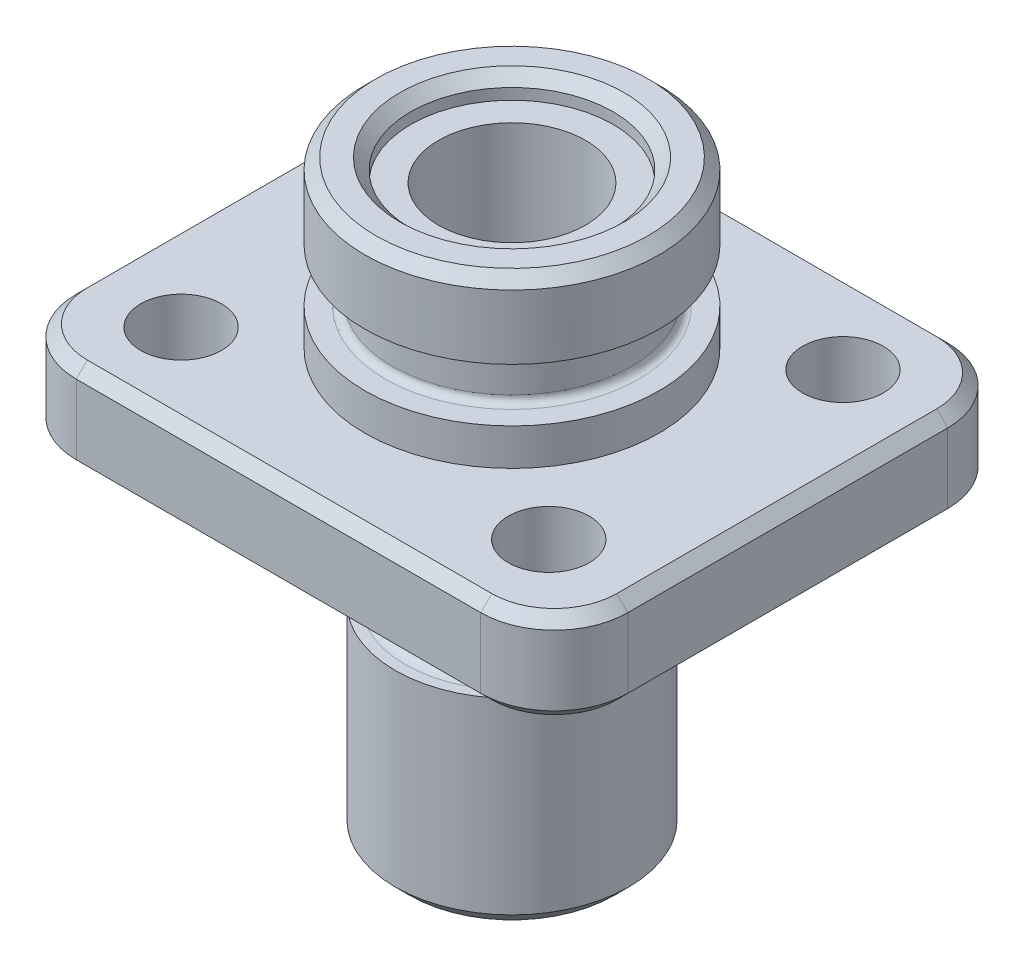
ISO-10303-21;
HEADER;
FILE_DESCRIPTION(('STEP AP214'),'2;1');
FILE_NAME('part.step','',(''),(''),'','','');
FILE_SCHEMA(('AUTOMOTIVE_DESIGN { 1 0 10303 214 1 1 1 1 }'));
ENDSEC;
DATA;
#1=APPLICATION_CONTEXT('core data for automotive mechanical design processes');
#2=APPLICATION_PROTOCOL_DEFINITION('international standard','automotive_design',2000,#1);
#3=PRODUCT_CONTEXT('',#1,'mechanical');
#4=PRODUCT('Part','Part','',(#3));
#5=PRODUCT_RELATED_PRODUCT_CATEGORY('part','',(#4));
#6=PRODUCT_DEFINITION_FORMATION('','',#4);
#7=PRODUCT_DEFINITION_CONTEXT('part definition',#1,'design');
#8=PRODUCT_DEFINITION('design','',#6,#7);
#9=PRODUCT_DEFINITION_SHAPE('','',#8);
#10=(LENGTH_UNIT() NAMED_UNIT(*) SI_UNIT(.MILLI.,.METRE.));
#11=(NAMED_UNIT(*) PLANE_ANGLE_UNIT() SI_UNIT($,.RADIAN.));
#12=(NAMED_UNIT(*) SI_UNIT($,.STERADIAN.) SOLID_ANGLE_UNIT());
#13=UNCERTAINTY_MEASURE_WITH_UNIT(LENGTH_MEASURE(1.E-05),#10,'distance_accuracy_value','');
#14=(GEOMETRIC_REPRESENTATION_CONTEXT(3) GLOBAL_UNCERTAINTY_ASSIGNED_CONTEXT((#13)) GLOBAL_UNIT_ASSIGNED_CONTEXT((#10,
#11,#12)) REPRESENTATION_CONTEXT('',''));
#15=CARTESIAN_POINT('',(0.,0.,0.));
#16=DIRECTION('',(0.,0.,1.));
#17=DIRECTION('',(1.,0.,0.));
#18=AXIS2_PLACEMENT_3D('',#15,#16,#17);
#19=CARTESIAN_POINT('',(0.,24.1986220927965,0.));
#20=DIRECTION('',(0.,1.,0.));
#21=DIRECTION('',(0.,0.,1.));
#22=AXIS2_PLACEMENT_3D('',#19,#20,#21);
#23=CYLINDRICAL_SURFACE('',#22,2.);
#24=CARTESIAN_POINT('',(0.,0.5,0.));
#25=DIRECTION('',(0.,1.,0.));
#26=DIRECTION('',(0.,0.,1.));
#27=AXIS2_PLACEMENT_3D('',#24,#25,#26);
#28=CIRCLE('',#27,2.);
#29=CARTESIAN_POINT('',(0.,0.5,2.));
#30=VERTEX_POINT('',#29);
#31=EDGE_CURVE('E1278',#30,#30,#28,.T.);
#32=ORIENTED_EDGE('',*,*,#31,.F.);
#33=EDGE_LOOP('',(#32));
#34=FACE_BOUND('',#33,.T.);
#35=CARTESIAN_POINT('',(0.,3.4,0.));
#36=DIRECTION('',(0.,1.,0.));
#37=DIRECTION('',(0.,0.,1.));
#38=AXIS2_PLACEMENT_3D('',#35,#36,#37);
#39=CIRCLE('',#38,2.);
#40=CARTESIAN_POINT('',(0.,3.4,2.));
#41=VERTEX_POINT('',#40);
#42=EDGE_CURVE('E1061',#41,#41,#39,.F.);
#43=ORIENTED_EDGE('',*,*,#42,.F.);
#44=EDGE_LOOP('',(#43));
#45=FACE_BOUND('',#44,.T.);
#46=ADVANCED_FACE('F43',(#34,#45),#23,.F.);
#47=CARTESIAN_POINT('',(0.,11.7014932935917,0.));
#48=DIRECTION('',(0.,1.,0.));
#49=DIRECTION('',(0.,0.,1.));
#50=AXIS2_PLACEMENT_3D('',#47,#48,#49);
#51=CYLINDRICAL_SURFACE('',#50,4.);
#52=CARTESIAN_POINT('',(0.,3.7,0.));
#53=DIRECTION('',(0.,1.,0.));
#54=DIRECTION('',(0.,0.,1.));
#55=AXIS2_PLACEMENT_3D('',#52,#53,#54);
#56=CIRCLE('',#55,4.);
#57=CARTESIAN_POINT('',(0.,3.7,4.));
#58=VERTEX_POINT('',#57);
#59=EDGE_CURVE('E253',#58,#58,#56,.F.);
#60=ORIENTED_EDGE('',*,*,#59,.T.);
#61=EDGE_LOOP('',(#60));
#62=FACE_BOUND('',#61,.T.);
#63=CARTESIAN_POINT('',(0.,1.95,0.));
#64=DIRECTION('',(0.,-1.,0.));
#65=DIRECTION('',(0.,0.,-1.));
#66=AXIS2_PLACEMENT_3D('',#63,#64,#65);
#67=CIRCLE('',#66,4.);
#68=CARTESIAN_POINT('',(0.,1.95,-4.));
#69=VERTEX_POINT('',#68);
#70=EDGE_CURVE('E1063',#69,#69,#67,.F.);
#71=ORIENTED_EDGE('',*,*,#70,.T.);
#72=EDGE_LOOP('',(#71));
#73=FACE_BOUND('',#72,.T.);
#74=ADVANCED_FACE('F295',(#62,#73),#51,.T.);
#75=CARTESIAN_POINT('',(0.,-0.5,0.));
#76=DIRECTION('',(0.,1.,0.));
#77=DIRECTION('',(0.,0.,1.));
#78=AXIS2_PLACEMENT_3D('',#75,#76,#77);
#79=CIRCLE('',#78,4.);
#80=CARTESIAN_POINT('',(0.,-0.5,4.));
#81=VERTEX_POINT('',#80);
#82=EDGE_CURVE('E1242',#81,#81,#79,.T.);
#83=ORIENTED_EDGE('',*,*,#82,.T.);
#84=EDGE_LOOP('',(#83));
#85=FACE_BOUND('',#84,.T.);
#86=CARTESIAN_POINT('',(0.,0.499999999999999,0.));
#87=DIRECTION('',(0.,1.,0.));
#88=DIRECTION('',(0.,0.,1.));
#89=AXIS2_PLACEMENT_3D('',#86,#87,#88);
#90=CIRCLE('',#89,4.);
#91=CARTESIAN_POINT('',(0.,0.499999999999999,4.));
#92=VERTEX_POINT('',#91);
#93=EDGE_CURVE('E1069',#92,#92,#90,.F.);
#94=ORIENTED_EDGE('',*,*,#93,.T.);
#95=EDGE_LOOP('',(#94));
#96=FACE_BOUND('',#95,.T.);
#97=ADVANCED_FACE('F301',(#85,#96),#51,.T.);
#98=CARTESIAN_POINT('',(7.5,4.5,6.35));
#99=DIRECTION('',(-1.,0.,0.));
#100=DIRECTION('',(0.,0.,1.));
#101=AXIS2_PLACEMENT_3D('',#98,#99,#100);
#102=PLANE('',#101);
#103=DIRECTION('',(0.,-1.,0.));
#104=VECTOR('',#103,1.);
#105=CARTESIAN_POINT('',(7.5,4.5,-4.35));
#106=LINE('',#105,#104);
#107=CARTESIAN_POINT('',(7.5,-2.7,-4.35));
#108=VERTEX_POINT('',#107);
#109=CARTESIAN_POINT('',(7.5,-0.800000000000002,-4.35));
#110=VERTEX_POINT('',#109);
#111=EDGE_CURVE('E1201',#108,#110,#106,.F.);
#112=ORIENTED_EDGE('',*,*,#111,.T.);
#113=DIRECTION('',(0.,0.,1.));
#114=VECTOR('',#113,1.);
#115=CARTESIAN_POINT('',(7.5,-0.800000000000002,4.35));
#116=LINE('',#115,#114);
#117=CARTESIAN_POINT('',(7.5,-0.800000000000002,4.35));
#118=VERTEX_POINT('',#117);
#119=EDGE_CURVE('E1127',#110,#118,#116,.T.);
#120=ORIENTED_EDGE('',*,*,#119,.T.);
#121=DIRECTION('',(0.,-1.,0.));
#122=VECTOR('',#121,1.);
#123=CARTESIAN_POINT('',(7.5,4.5,4.35));
#124=LINE('',#123,#122);
#125=CARTESIAN_POINT('',(7.5,-2.7,4.35));
#126=VERTEX_POINT('',#125);
#127=EDGE_CURVE('E1198',#118,#126,#124,.T.);
#128=ORIENTED_EDGE('',*,*,#127,.T.);
#129=DIRECTION('',(0.,0.,-1.));
#130=VECTOR('',#129,1.);
#131=CARTESIAN_POINT('',(7.5,-2.7,-4.35));
#132=LINE('',#131,#130);
#133=EDGE_CURVE('E1124',#126,#108,#132,.T.);
#134=ORIENTED_EDGE('',*,*,#133,.T.);
#135=EDGE_LOOP('',(#112,#120,#128,#134));
#136=FACE_BOUND('',#135,.T.);
#137=ADVANCED_FACE('F345',(#136),#102,.F.);
#138=CARTESIAN_POINT('',(-7.5,4.5,-6.35));
#139=DIRECTION('',(0.,0.,1.));
#140=DIRECTION('',(1.,0.,0.));
#141=AXIS2_PLACEMENT_3D('',#138,#139,#140);
#142=PLANE('',#141);
#143=DIRECTION('',(0.,-1.,0.));
#144=VECTOR('',#143,1.);
#145=CARTESIAN_POINT('',(-5.5,4.5,-6.35));
#146=LINE('',#145,#144);
#147=CARTESIAN_POINT('',(-5.5,-2.7,-6.35));
#148=VERTEX_POINT('',#147);
#149=CARTESIAN_POINT('',(-5.5,-0.800000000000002,-6.35));
#150=VERTEX_POINT('',#149);
#151=EDGE_CURVE('E1205',#148,#150,#146,.F.);
#152=ORIENTED_EDGE('',*,*,#151,.T.);
#153=DIRECTION('',(1.,0.,0.));
#154=VECTOR('',#153,1.);
#155=CARTESIAN_POINT('',(5.5,-0.800000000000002,-6.35));
#156=LINE('',#155,#154);
#157=CARTESIAN_POINT('',(5.5,-0.800000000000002,-6.35));
#158=VERTEX_POINT('',#157);
#159=EDGE_CURVE('E1150',#150,#158,#156,.T.);
#160=ORIENTED_EDGE('',*,*,#159,.T.);
#161=DIRECTION('',(0.,-1.,0.));
#162=VECTOR('',#161,1.);
#163=CARTESIAN_POINT('',(5.5,4.5,-6.35));
#164=LINE('',#163,#162);
#165=CARTESIAN_POINT('',(5.5,-2.7,-6.35));
#166=VERTEX_POINT('',#165);
#167=EDGE_CURVE('E1209',#158,#166,#164,.T.);
#168=ORIENTED_EDGE('',*,*,#167,.T.);
#169=DIRECTION('',(-1.,0.,0.));
#170=VECTOR('',#169,1.);
#171=CARTESIAN_POINT('',(-5.5,-2.7,-6.35));
#172=LINE('',#171,#170);
#173=EDGE_CURVE('E1147',#166,#148,#172,.T.);
#174=ORIENTED_EDGE('',*,*,#173,.T.);
#175=EDGE_LOOP('',(#152,#160,#168,#174));
#176=FACE_BOUND('',#175,.T.);
#177=ADVANCED_FACE('F391',(#176),#142,.F.);
#178=CARTESIAN_POINT('',(-7.5,4.5,6.35));
#179=DIRECTION('',(1.,0.,0.));
#180=DIRECTION('',(0.,0.,-1.));
#181=AXIS2_PLACEMENT_3D('',#178,#179,#180);
#182=PLANE('',#181);
#183=DIRECTION('',(0.,-1.,0.));
#184=VECTOR('',#183,1.);
#185=CARTESIAN_POINT('',(-7.5,4.5,4.35));
#186=LINE('',#185,#184);
#187=CARTESIAN_POINT('',(-7.5,-2.7,4.35));
#188=VERTEX_POINT('',#187);
#189=CARTESIAN_POINT('',(-7.5,-0.800000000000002,4.35));
#190=VERTEX_POINT('',#189);
#191=EDGE_CURVE('E1211',#188,#190,#186,.F.);
#192=ORIENTED_EDGE('',*,*,#191,.T.);
#193=DIRECTION('',(0.,0.,-1.));
#194=VECTOR('',#193,1.);
#195=CARTESIAN_POINT('',(-7.5,-0.800000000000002,-4.35));
#196=LINE('',#195,#194);
#197=CARTESIAN_POINT('',(-7.5,-0.800000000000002,-4.35));
#198=VERTEX_POINT('',#197);
#199=EDGE_CURVE('E1133',#190,#198,#196,.T.);
#200=ORIENTED_EDGE('',*,*,#199,.T.);
#201=DIRECTION('',(0.,-1.,0.));
#202=VECTOR('',#201,1.);
#203=CARTESIAN_POINT('',(-7.5,4.5,-4.35));
#204=LINE('',#203,#202);
#205=CARTESIAN_POINT('',(-7.5,-2.7,-4.35));
#206=VERTEX_POINT('',#205);
#207=EDGE_CURVE('E1316',#198,#206,#204,.T.);
#208=ORIENTED_EDGE('',*,*,#207,.T.);
#209=DIRECTION('',(0.,0.,1.));
#210=VECTOR('',#209,1.);
#211=CARTESIAN_POINT('',(-7.5,-2.7,4.35));
#212=LINE('',#211,#210);
#213=EDGE_CURVE('E1130',#206,#188,#212,.T.);
#214=ORIENTED_EDGE('',*,*,#213,.T.);
#215=EDGE_LOOP('',(#192,#200,#208,#214));
#216=FACE_BOUND('',#215,.T.);
#217=ADVANCED_FACE('F387',(#216),#182,.F.);
#218=CARTESIAN_POINT('',(-7.5,4.5,6.35));
#219=DIRECTION('',(0.,0.,-1.));
#220=DIRECTION('',(-1.,0.,0.));
#221=AXIS2_PLACEMENT_3D('',#218,#219,#220);
#222=PLANE('',#221);
#223=DIRECTION('',(0.,-1.,0.));
#224=VECTOR('',#223,1.);
#225=CARTESIAN_POINT('',(5.5,4.5,6.35));
#226=LINE('',#225,#224);
#227=CARTESIAN_POINT('',(5.5,-2.7,6.35));
#228=VERTEX_POINT('',#227);
#229=CARTESIAN_POINT('',(5.5,-0.800000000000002,6.35));
#230=VERTEX_POINT('',#229);
#231=EDGE_CURVE('E1280',#228,#230,#226,.F.);
#232=ORIENTED_EDGE('',*,*,#231,.T.);
#233=DIRECTION('',(-1.,0.,0.));
#234=VECTOR('',#233,1.);
#235=CARTESIAN_POINT('',(-5.5,-0.800000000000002,6.35));
#236=LINE('',#235,#234);
#237=CARTESIAN_POINT('',(-5.5,-0.800000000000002,6.35));
#238=VERTEX_POINT('',#237);
#239=EDGE_CURVE('E1108',#230,#238,#236,.T.);
#240=ORIENTED_EDGE('',*,*,#239,.T.);
#241=DIRECTION('',(0.,-1.,0.));
#242=VECTOR('',#241,1.);
#243=CARTESIAN_POINT('',(-5.5,4.5,6.35));
#244=LINE('',#243,#242);
#245=CARTESIAN_POINT('',(-5.5,-2.7,6.35));
#246=VERTEX_POINT('',#245);
#247=EDGE_CURVE('E1281',#238,#246,#244,.T.);
#248=ORIENTED_EDGE('',*,*,#247,.T.);
#249=DIRECTION('',(1.,0.,0.));
#250=VECTOR('',#249,1.);
#251=CARTESIAN_POINT('',(5.5,-2.7,6.35));
#252=LINE('',#251,#250);
#253=EDGE_CURVE('E1104',#246,#228,#252,.T.);
#254=ORIENTED_EDGE('',*,*,#253,.T.);
#255=EDGE_LOOP('',(#232,#240,#248,#254));
#256=FACE_BOUND('',#255,.T.);
#257=ADVANCED_FACE('F383',(#256),#222,.F.);
#258=CARTESIAN_POINT('',(-5.5,4.5,4.35));
#259=DIRECTION('',(0.,-1.,0.));
#260=DIRECTION('',(0.,0.,-1.));
#261=AXIS2_PLACEMENT_3D('',#258,#259,#260);
#262=CYLINDRICAL_SURFACE('',#261,2.);
#263=ORIENTED_EDGE('',*,*,#247,.F.);
#264=CARTESIAN_POINT('',(-5.5,-0.800000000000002,4.35));
#265=DIRECTION('',(0.,1.,0.));
#266=DIRECTION('',(0.,0.,1.));
#267=AXIS2_PLACEMENT_3D('',#264,#265,#266);
#268=CIRCLE('',#267,2.);
#269=EDGE_CURVE('E1121',#238,#190,#268,.F.);
#270=ORIENTED_EDGE('',*,*,#269,.T.);
#271=ORIENTED_EDGE('',*,*,#191,.F.);
#272=CARTESIAN_POINT('',(-5.5,-2.7,4.35));
#273=DIRECTION('',(0.,-1.,0.));
#274=DIRECTION('',(0.,0.,-1.));
#275=AXIS2_PLACEMENT_3D('',#272,#273,#274);
#276=CIRCLE('',#275,2.);
#277=EDGE_CURVE('E1118',#188,#246,#276,.F.);
#278=ORIENTED_EDGE('',*,*,#277,.T.);
#279=EDGE_LOOP('',(#263,#270,#271,#278));
#280=FACE_BOUND('',#279,.T.);
#281=ADVANCED_FACE('F386',(#280),#262,.T.);
#282=CARTESIAN_POINT('',(5.5,4.5,4.35));
#283=DIRECTION('',(0.,-1.,0.));
#284=DIRECTION('',(0.,0.,-1.));
#285=AXIS2_PLACEMENT_3D('',#282,#283,#284);
#286=CYLINDRICAL_SURFACE('',#285,2.);
#287=ORIENTED_EDGE('',*,*,#127,.F.);
#288=CARTESIAN_POINT('',(5.5,-0.800000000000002,4.35));
#289=DIRECTION('',(0.,1.,0.));
#290=DIRECTION('',(0.,0.,1.));
#291=AXIS2_PLACEMENT_3D('',#288,#289,#290);
#292=CIRCLE('',#291,2.);
#293=EDGE_CURVE('E1115',#118,#230,#292,.F.);
#294=ORIENTED_EDGE('',*,*,#293,.T.);
#295=ORIENTED_EDGE('',*,*,#231,.F.);
#296=CARTESIAN_POINT('',(5.5,-2.7,4.35));
#297=DIRECTION('',(0.,-1.,0.));
#298=DIRECTION('',(0.,0.,-1.));
#299=AXIS2_PLACEMENT_3D('',#296,#297,#298);
#300=CIRCLE('',#299,2.);
#301=EDGE_CURVE('E1112',#228,#126,#300,.F.);
#302=ORIENTED_EDGE('',*,*,#301,.T.);
#303=EDGE_LOOP('',(#287,#294,#295,#302));
#304=FACE_BOUND('',#303,.T.);
#305=ADVANCED_FACE('F401',(#304),#286,.T.);
#306=CARTESIAN_POINT('',(5.5,4.5,-4.35));
#307=DIRECTION('',(0.,-1.,0.));
#308=DIRECTION('',(0.,0.,-1.));
#309=AXIS2_PLACEMENT_3D('',#306,#307,#308);
#310=CYLINDRICAL_SURFACE('',#309,2.);
#311=ORIENTED_EDGE('',*,*,#167,.F.);
#312=CARTESIAN_POINT('',(5.5,-0.800000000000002,-4.35));
#313=DIRECTION('',(0.,1.,0.));
#314=DIRECTION('',(0.,0.,1.));
#315=AXIS2_PLACEMENT_3D('',#312,#313,#314);
#316=CIRCLE('',#315,2.);
#317=EDGE_CURVE('E188',#158,#110,#316,.F.);
#318=ORIENTED_EDGE('',*,*,#317,.T.);
#319=ORIENTED_EDGE('',*,*,#111,.F.);
#320=CARTESIAN_POINT('',(5.5,-2.7,-4.35));
#321=DIRECTION('',(0.,-1.,0.));
#322=DIRECTION('',(0.,0.,-1.));
#323=AXIS2_PLACEMENT_3D('',#320,#321,#322);
#324=CIRCLE('',#323,2.);
#325=EDGE_CURVE('E1136',#108,#166,#324,.F.);
#326=ORIENTED_EDGE('',*,*,#325,.T.);
#327=EDGE_LOOP('',(#311,#318,#319,#326));
#328=FACE_BOUND('',#327,.T.);
#329=ADVANCED_FACE('F405',(#328),#310,.T.);
#330=CARTESIAN_POINT('',(-5.5,4.5,-4.35));
#331=DIRECTION('',(0.,-1.,0.));
#332=DIRECTION('',(0.,0.,-1.));
#333=AXIS2_PLACEMENT_3D('',#330,#331,#332);
#334=CYLINDRICAL_SURFACE('',#333,2.);
#335=ORIENTED_EDGE('',*,*,#207,.F.);
#336=CARTESIAN_POINT('',(-5.5,-0.800000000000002,-4.35));
#337=DIRECTION('',(0.,1.,0.));
#338=DIRECTION('',(0.,0.,1.));
#339=AXIS2_PLACEMENT_3D('',#336,#337,#338);
#340=CIRCLE('',#339,2.);
#341=EDGE_CURVE('E1144',#198,#150,#340,.F.);
#342=ORIENTED_EDGE('',*,*,#341,.T.);
#343=ORIENTED_EDGE('',*,*,#151,.F.);
#344=CARTESIAN_POINT('',(-5.5,-2.7,-4.35));
#345=DIRECTION('',(0.,-1.,0.));
#346=DIRECTION('',(0.,0.,-1.));
#347=AXIS2_PLACEMENT_3D('',#344,#345,#346);
#348=CIRCLE('',#347,2.);
#349=EDGE_CURVE('E1141',#148,#206,#348,.F.);
#350=ORIENTED_EDGE('',*,*,#349,.T.);
#351=EDGE_LOOP('',(#335,#342,#343,#350));
#352=FACE_BOUND('',#351,.T.);
#353=ADVANCED_FACE('F381',(#352),#334,.T.);
#354=CARTESIAN_POINT('',(-2.775,-12.,0.));
#355=DIRECTION('',(0.,-1.,0.));
#356=DIRECTION('',(0.,0.,-1.));
#357=AXIS2_PLACEMENT_3D('',#354,#355,#356);
#358=PLANE('',#357);
#359=CARTESIAN_POINT('',(0.,-12.,0.));
#360=DIRECTION('',(0.,1.,0.));
#361=DIRECTION('',(0.,0.,1.));
#362=AXIS2_PLACEMENT_3D('',#359,#360,#361);
#363=CIRCLE('',#362,2.3);
#364=CARTESIAN_POINT('',(0.,-12.,2.3));
#365=VERTEX_POINT('',#364);
#366=EDGE_CURVE('E1288',#365,#365,#363,.T.);
#367=ORIENTED_EDGE('',*,*,#366,.T.);
#368=EDGE_LOOP('',(#367));
#369=FACE_BOUND('',#368,.T.);
#370=CARTESIAN_POINT('',(0.,-12.,0.));
#371=DIRECTION('',(0.,1.,0.));
#372=DIRECTION('',(0.,0.,1.));
#373=AXIS2_PLACEMENT_3D('',#370,#371,#372);
#374=CIRCLE('',#373,2.775);
#375=CARTESIAN_POINT('',(0.,-12.,2.775));
#376=VERTEX_POINT('',#375);
#377=EDGE_CURVE('E1282',#376,#376,#374,.T.);
#378=ORIENTED_EDGE('',*,*,#377,.F.);
#379=EDGE_LOOP('',(#378));
#380=FACE_BOUND('',#379,.T.);
#381=ADVANCED_FACE('F377',(#369,#380),#358,.T.);
#382=CARTESIAN_POINT('',(0.,-11.6,0.));
#383=DIRECTION('',(0.,1.,0.));
#384=DIRECTION('',(0.,0.,1.));
#385=AXIS2_PLACEMENT_3D('',#382,#383,#384);
#386=CONICAL_SURFACE('',#385,3.175,0.785398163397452);
#387=ORIENTED_EDGE('',*,*,#377,.T.);
#388=EDGE_LOOP('',(#387));
#389=FACE_BOUND('',#388,.T.);
#390=CARTESIAN_POINT('',(0.,-11.6,0.));
#391=DIRECTION('',(0.,1.,0.));
#392=DIRECTION('',(0.,0.,1.));
#393=AXIS2_PLACEMENT_3D('',#390,#391,#392);
#394=CIRCLE('',#393,3.175);
#395=CARTESIAN_POINT('',(0.,-11.6,3.175));
#396=VERTEX_POINT('',#395);
#397=EDGE_CURVE('E1306',#396,#396,#394,.T.);
#398=ORIENTED_EDGE('',*,*,#397,.F.);
#399=EDGE_LOOP('',(#398));
#400=FACE_BOUND('',#399,.T.);
#401=ADVANCED_FACE('F373',(#389,#400),#386,.T.);
#402=CARTESIAN_POINT('',(0.,11.7014932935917,0.));
#403=DIRECTION('',(0.,1.,0.));
#404=DIRECTION('',(0.,0.,1.));
#405=AXIS2_PLACEMENT_3D('',#402,#403,#404);
#406=CYLINDRICAL_SURFACE('',#405,3.175);
#407=ORIENTED_EDGE('',*,*,#397,.T.);
#408=EDGE_LOOP('',(#407));
#409=FACE_BOUND('',#408,.T.);
#410=CARTESIAN_POINT('',(0.,-6.5,0.));
#411=DIRECTION('',(0.,1.,0.));
#412=DIRECTION('',(0.,0.,1.));
#413=AXIS2_PLACEMENT_3D('',#410,#411,#412);
#414=CIRCLE('',#413,3.175);
#415=CARTESIAN_POINT('',(0.,-6.5,3.175));
#416=VERTEX_POINT('',#415);
#417=EDGE_CURVE('E1270',#416,#416,#414,.T.);
#418=ORIENTED_EDGE('',*,*,#417,.F.);
#419=EDGE_LOOP('',(#418));
#420=FACE_BOUND('',#419,.T.);
#421=ADVANCED_FACE('F369',(#409,#420),#406,.T.);
#422=CARTESIAN_POINT('',(-3.175,-6.5,0.));
#423=DIRECTION('',(0.,1.,0.));
#424=DIRECTION('',(0.,0.,1.));
#425=AXIS2_PLACEMENT_3D('',#422,#423,#424);
#426=PLANE('',#425);
#427=ORIENTED_EDGE('',*,*,#417,.T.);
#428=EDGE_LOOP('',(#427));
#429=FACE_BOUND('',#428,.T.);
#430=CARTESIAN_POINT('',(0.,-6.5,0.));
#431=DIRECTION('',(0.,1.,0.));
#432=DIRECTION('',(0.,0.,1.));
#433=AXIS2_PLACEMENT_3D('',#430,#431,#432);
#434=CIRCLE('',#433,2.9);
#435=CARTESIAN_POINT('',(0.,-6.5,2.9));
#436=VERTEX_POINT('',#435);
#437=EDGE_CURVE('E1268',#436,#436,#434,.T.);
#438=ORIENTED_EDGE('',*,*,#437,.F.);
#439=EDGE_LOOP('',(#438));
#440=FACE_BOUND('',#439,.T.);
#441=ADVANCED_FACE('F365',(#429,#440),#426,.T.);
#442=CARTESIAN_POINT('',(0.,-6.2,0.));
#443=DIRECTION('',(0.,1.,0.));
#444=DIRECTION('',(0.,0.,1.));
#445=AXIS2_PLACEMENT_3D('',#442,#443,#444);
#446=TOROIDAL_SURFACE('',#445,2.9,0.3);
#447=ORIENTED_EDGE('',*,*,#437,.T.);
#448=EDGE_LOOP('',(#447));
#449=FACE_BOUND('',#448,.T.);
#450=CARTESIAN_POINT('',(0.,-6.2,0.));
#451=DIRECTION('',(0.,1.,0.));
#452=DIRECTION('',(0.,0.,1.));
#453=AXIS2_PLACEMENT_3D('',#450,#451,#452);
#454=CIRCLE('',#453,2.6);
#455=CARTESIAN_POINT('',(0.,-6.2,2.6));
#456=VERTEX_POINT('',#455);
#457=EDGE_CURVE('E1271',#456,#456,#454,.T.);
#458=ORIENTED_EDGE('',*,*,#457,.F.);
#459=EDGE_LOOP('',(#458));
#460=FACE_BOUND('',#459,.T.);
#461=ADVANCED_FACE('F361',(#449,#460),#446,.F.);
#462=CARTESIAN_POINT('',(0.,11.7014932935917,0.));
#463=DIRECTION('',(0.,1.,0.));
#464=DIRECTION('',(0.,0.,1.));
#465=AXIS2_PLACEMENT_3D('',#462,#463,#464);
#466=CYLINDRICAL_SURFACE('',#465,2.6);
#467=ORIENTED_EDGE('',*,*,#457,.T.);
#468=EDGE_LOOP('',(#467));
#469=FACE_BOUND('',#468,.T.);
#470=CARTESIAN_POINT('',(0.,-5.3,0.));
#471=DIRECTION('',(0.,1.,0.));
#472=DIRECTION('',(0.,0.,1.));
#473=AXIS2_PLACEMENT_3D('',#470,#471,#472);
#474=CIRCLE('',#473,2.6);
#475=CARTESIAN_POINT('',(0.,-5.3,2.6));
#476=VERTEX_POINT('',#475);
#477=EDGE_CURVE('E1287',#476,#476,#474,.T.);
#478=ORIENTED_EDGE('',*,*,#477,.F.);
#479=EDGE_LOOP('',(#478));
#480=FACE_BOUND('',#479,.T.);
#481=ADVANCED_FACE('F357',(#469,#480),#466,.T.);
#482=CARTESIAN_POINT('',(0.,-5.3,0.));
#483=DIRECTION('',(0.,1.,0.));
#484=DIRECTION('',(0.,0.,1.));
#485=AXIS2_PLACEMENT_3D('',#482,#483,#484);
#486=TOROIDAL_SURFACE('',#485,2.9,0.3);
#487=ORIENTED_EDGE('',*,*,#477,.T.);
#488=EDGE_LOOP('',(#487));
#489=FACE_BOUND('',#488,.T.);
#490=CARTESIAN_POINT('',(0.,-5.,0.));
#491=DIRECTION('',(0.,1.,0.));
#492=DIRECTION('',(0.,0.,1.));
#493=AXIS2_PLACEMENT_3D('',#490,#491,#492);
#494=CIRCLE('',#493,2.9);
#495=CARTESIAN_POINT('',(0.,-5.,2.9));
#496=VERTEX_POINT('',#495);
#497=EDGE_CURVE('E1285',#496,#496,#494,.T.);
#498=ORIENTED_EDGE('',*,*,#497,.F.);
#499=EDGE_LOOP('',(#498));
#500=FACE_BOUND('',#499,.T.);
#501=ADVANCED_FACE('F353',(#489,#500),#486,.F.);
#502=CARTESIAN_POINT('',(-3.5,-5.,0.));
#503=DIRECTION('',(0.,-1.,0.));
#504=DIRECTION('',(0.,0.,-1.));
#505=AXIS2_PLACEMENT_3D('',#502,#503,#504);
#506=PLANE('',#505);
#507=CARTESIAN_POINT('',(0.,-5.,0.));
#508=DIRECTION('',(0.,-1.,0.));
#509=DIRECTION('',(0.,0.,-1.));
#510=AXIS2_PLACEMENT_3D('',#507,#508,#509);
#511=CIRCLE('',#510,3.2);
#512=CARTESIAN_POINT('',(0.,-5.,-3.2));
#513=VERTEX_POINT('',#512);
#514=EDGE_CURVE('E1222',#513,#513,#511,.T.);
#515=ORIENTED_EDGE('',*,*,#514,.T.);
#516=EDGE_LOOP('',(#515));
#517=FACE_BOUND('',#516,.T.);
#518=ORIENTED_EDGE('',*,*,#497,.T.);
#519=EDGE_LOOP('',(#518));
#520=FACE_BOUND('',#519,.T.);
#521=ADVANCED_FACE('F349',(#517,#520),#506,.T.);
#522=CARTESIAN_POINT('',(0.,11.7014932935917,0.));
#523=DIRECTION('',(0.,1.,0.));
#524=DIRECTION('',(0.,0.,1.));
#525=AXIS2_PLACEMENT_3D('',#522,#523,#524);
#526=CYLINDRICAL_SURFACE('',#525,3.5);
#527=CARTESIAN_POINT('',(0.,-3.,0.));
#528=DIRECTION('',(0.,-1.,0.));
#529=DIRECTION('',(0.,0.,-1.));
#530=AXIS2_PLACEMENT_3D('',#527,#528,#529);
#531=CIRCLE('',#530,3.5);
#532=CARTESIAN_POINT('',(0.,-3.,-3.5));
#533=VERTEX_POINT('',#532);
#534=EDGE_CURVE('E1234',#533,#533,#531,.F.);
#535=ORIENTED_EDGE('',*,*,#534,.F.);
#536=EDGE_LOOP('',(#535));
#537=FACE_BOUND('',#536,.T.);
#538=CARTESIAN_POINT('',(0.,-4.7,0.));
#539=DIRECTION('',(0.,-1.,0.));
#540=DIRECTION('',(0.,0.,-1.));
#541=AXIS2_PLACEMENT_3D('',#538,#539,#540);
#542=CIRCLE('',#541,3.5);
#543=CARTESIAN_POINT('',(0.,-4.7,-3.5));
#544=VERTEX_POINT('',#543);
#545=EDGE_CURVE('E1218',#544,#544,#542,.F.);
#546=ORIENTED_EDGE('',*,*,#545,.T.);
#547=EDGE_LOOP('',(#546));
#548=FACE_BOUND('',#547,.T.);
#549=ADVANCED_FACE('F341',(#537,#548),#526,.T.);
#550=CARTESIAN_POINT('',(0.,24.1986220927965,0.));
#551=DIRECTION('',(0.,1.,0.));
#552=DIRECTION('',(0.,0.,1.));
#553=AXIS2_PLACEMENT_3D('',#550,#551,#552);
#554=CYLINDRICAL_SURFACE('',#553,2.3);
#555=ORIENTED_EDGE('',*,*,#366,.F.);
#556=EDGE_LOOP('',(#555));
#557=FACE_BOUND('',#556,.T.);
#558=CARTESIAN_POINT('',(0.,-9.8,0.));
#559=DIRECTION('',(0.,1.,0.));
#560=DIRECTION('',(0.,0.,1.));
#561=AXIS2_PLACEMENT_3D('',#558,#559,#560);
#562=CIRCLE('',#561,2.3);
#563=CARTESIAN_POINT('',(0.,-9.8,2.3));
#564=VERTEX_POINT('',#563);
#565=EDGE_CURVE('E1296',#564,#564,#562,.T.);
#566=ORIENTED_EDGE('',*,*,#565,.T.);
#567=EDGE_LOOP('',(#566));
#568=FACE_BOUND('',#567,.T.);
#569=ADVANCED_FACE('F338',(#557,#568),#554,.F.);
#570=CARTESIAN_POINT('',(0.,-9.8,2.3));
#571=DIRECTION('',(0.,1.,0.));
#572=DIRECTION('',(0.,0.,1.));
#573=AXIS2_PLACEMENT_3D('',#570,#571,#572);
#574=PLANE('',#573);
#575=ORIENTED_EDGE('',*,*,#565,.F.);
#576=EDGE_LOOP('',(#575));
#577=FACE_BOUND('',#576,.T.);
#578=CARTESIAN_POINT('',(0.,-9.8,0.));
#579=DIRECTION('',(0.,1.,0.));
#580=DIRECTION('',(0.,0.,1.));
#581=AXIS2_PLACEMENT_3D('',#578,#579,#580);
#582=CIRCLE('',#581,2.);
#583=CARTESIAN_POINT('',(0.,-9.8,2.));
#584=VERTEX_POINT('',#583);
#585=EDGE_CURVE('E1265',#584,#584,#582,.T.);
#586=ORIENTED_EDGE('',*,*,#585,.T.);
#587=EDGE_LOOP('',(#586));
#588=FACE_BOUND('',#587,.T.);
#589=ADVANCED_FACE('F334',(#577,#588),#574,.F.);
#590=CARTESIAN_POINT('',(0.,24.1986220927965,0.));
#591=DIRECTION('',(0.,1.,0.));
#592=DIRECTION('',(0.,0.,1.));
#593=AXIS2_PLACEMENT_3D('',#590,#591,#592);
#594=CYLINDRICAL_SURFACE('',#593,2.);
#595=ORIENTED_EDGE('',*,*,#585,.F.);
#596=EDGE_LOOP('',(#595));
#597=FACE_BOUND('',#596,.T.);
#598=CARTESIAN_POINT('',(0.,-3.4,0.));
#599=DIRECTION('',(0.,1.,0.));
#600=DIRECTION('',(0.,0.,1.));
#601=AXIS2_PLACEMENT_3D('',#598,#599,#600);
#602=CIRCLE('',#601,2.);
#603=CARTESIAN_POINT('',(0.,-3.4,2.));
#604=VERTEX_POINT('',#603);
#605=EDGE_CURVE('E1262',#604,#604,#602,.T.);
#606=ORIENTED_EDGE('',*,*,#605,.T.);
#607=EDGE_LOOP('',(#606));
#608=FACE_BOUND('',#607,.T.);
#609=ADVANCED_FACE('F330',(#597,#608),#594,.F.);
#610=CARTESIAN_POINT('',(0.,-3.4,2.));
#611=DIRECTION('',(0.,1.,0.));
#612=DIRECTION('',(0.,0.,1.));
#613=AXIS2_PLACEMENT_3D('',#610,#611,#612);
#614=PLANE('',#613);
#615=ORIENTED_EDGE('',*,*,#605,.F.);
#616=EDGE_LOOP('',(#615));
#617=FACE_BOUND('',#616,.T.);
#618=CARTESIAN_POINT('',(0.,-3.4,0.));
#619=DIRECTION('',(0.,1.,0.));
#620=DIRECTION('',(0.,0.,1.));
#621=AXIS2_PLACEMENT_3D('',#618,#619,#620);
#622=CIRCLE('',#621,1.8);
#623=CARTESIAN_POINT('',(0.,-3.4,1.8));
#624=VERTEX_POINT('',#623);
#625=EDGE_CURVE('E1266',#624,#624,#622,.T.);
#626=ORIENTED_EDGE('',*,*,#625,.T.);
#627=EDGE_LOOP('',(#626));
#628=FACE_BOUND('',#627,.T.);
#629=ADVANCED_FACE('F326',(#617,#628),#614,.F.);
#630=CARTESIAN_POINT('',(0.,24.1986220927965,0.));
#631=DIRECTION('',(0.,1.,0.));
#632=DIRECTION('',(0.,0.,1.));
#633=AXIS2_PLACEMENT_3D('',#630,#631,#632);
#634=CYLINDRICAL_SURFACE('',#633,1.8);
#635=ORIENTED_EDGE('',*,*,#625,.F.);
#636=EDGE_LOOP('',(#635));
#637=FACE_BOUND('',#636,.T.);
#638=CARTESIAN_POINT('',(0.,-0.5,0.));
#639=DIRECTION('',(0.,1.,0.));
#640=DIRECTION('',(0.,0.,1.));
#641=AXIS2_PLACEMENT_3D('',#638,#639,#640);
#642=CIRCLE('',#641,1.8);
#643=CARTESIAN_POINT('',(0.,-0.5,1.8));
#644=VERTEX_POINT('',#643);
#645=EDGE_CURVE('E1277',#644,#644,#642,.T.);
#646=ORIENTED_EDGE('',*,*,#645,.T.);
#647=EDGE_LOOP('',(#646));
#648=FACE_BOUND('',#647,.T.);
#649=ADVANCED_FACE('F322',(#637,#648),#634,.F.);
#650=CARTESIAN_POINT('',(0.,-0.5,1.8));
#651=DIRECTION('',(0.,1.,0.));
#652=DIRECTION('',(0.,0.,1.));
#653=AXIS2_PLACEMENT_3D('',#650,#651,#652);
#654=PLANE('',#653);
#655=ORIENTED_EDGE('',*,*,#645,.F.);
#656=EDGE_LOOP('',(#655));
#657=FACE_BOUND('',#656,.T.);
#658=CARTESIAN_POINT('',(0.,-0.5,0.));
#659=DIRECTION('',(0.,1.,0.));
#660=DIRECTION('',(0.,0.,1.));
#661=AXIS2_PLACEMENT_3D('',#658,#659,#660);
#662=CIRCLE('',#661,1.1);
#663=CARTESIAN_POINT('',(0.,-0.5,1.1));
#664=VERTEX_POINT('',#663);
#665=EDGE_CURVE('E1274',#664,#664,#662,.T.);
#666=ORIENTED_EDGE('',*,*,#665,.T.);
#667=EDGE_LOOP('',(#666));
#668=FACE_BOUND('',#667,.T.);
#669=ADVANCED_FACE('F318',(#657,#668),#654,.F.);
#670=CARTESIAN_POINT('',(0.,24.1986220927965,0.));
#671=DIRECTION('',(0.,1.,0.));
#672=DIRECTION('',(0.,0.,1.));
#673=AXIS2_PLACEMENT_3D('',#670,#671,#672);
#674=CYLINDRICAL_SURFACE('',#673,1.1);
#675=CARTESIAN_POINT('',(0.,0.,0.));
#676=DIRECTION('',(0.,-1.,0.));
#677=DIRECTION('',(0.,0.,-1.));
#678=AXIS2_PLACEMENT_3D('',#675,#676,#677);
#679=CIRCLE('',#678,1.1);
#680=CARTESIAN_POINT('',(0.,0.,-1.1));
#681=VERTEX_POINT('',#680);
#682=EDGE_CURVE('E1226',#681,#681,#679,.F.);
#683=ORIENTED_EDGE('',*,*,#682,.T.);
#684=EDGE_LOOP('',(#683));
#685=FACE_BOUND('',#684,.T.);
#686=ORIENTED_EDGE('',*,*,#665,.F.);
#687=EDGE_LOOP('',(#686));
#688=FACE_BOUND('',#687,.T.);
#689=ADVANCED_FACE('F314',(#685,#688),#674,.F.);
#690=CARTESIAN_POINT('',(0.,0.5,1.1));
#691=DIRECTION('',(0.,-1.,0.));
#692=DIRECTION('',(0.,0.,-1.));
#693=AXIS2_PLACEMENT_3D('',#690,#691,#692);
#694=PLANE('',#693);
#695=CARTESIAN_POINT('',(0.,0.5,0.));
#696=DIRECTION('',(0.,-1.,0.));
#697=DIRECTION('',(0.,0.,-1.));
#698=AXIS2_PLACEMENT_3D('',#695,#696,#697);
#699=CIRCLE('',#698,1.6);
#700=CARTESIAN_POINT('',(0.,0.5,-1.6));
#701=VERTEX_POINT('',#700);
#702=EDGE_CURVE('E1230',#701,#701,#699,.T.);
#703=ORIENTED_EDGE('',*,*,#702,.T.);
#704=EDGE_LOOP('',(#703));
#705=FACE_BOUND('',#704,.T.);
#706=ORIENTED_EDGE('',*,*,#31,.T.);
#707=EDGE_LOOP('',(#706));
#708=FACE_BOUND('',#707,.T.);
#709=ADVANCED_FACE('F310',(#705,#708),#694,.F.);
#710=CARTESIAN_POINT('',(0.,-4.7,0.));
#711=DIRECTION('',(0.,1.,0.));
#712=DIRECTION('',(0.,0.,1.));
#713=AXIS2_PLACEMENT_3D('',#710,#711,#712);
#714=CONICAL_SURFACE('',#713,3.5,0.785398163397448);
#715=ORIENTED_EDGE('',*,*,#514,.F.);
#716=EDGE_LOOP('',(#715));
#717=FACE_BOUND('',#716,.T.);
#718=ORIENTED_EDGE('',*,*,#545,.F.);
#719=EDGE_LOOP('',(#718));
#720=FACE_BOUND('',#719,.T.);
#721=ADVANCED_FACE('F313',(#717,#720),#714,.T.);
#722=CARTESIAN_POINT('',(0.,0.,0.));
#723=DIRECTION('',(0.,1.,0.));
#724=DIRECTION('',(0.,0.,1.));
#725=AXIS2_PLACEMENT_3D('',#722,#723,#724);
#726=CONICAL_SURFACE('',#725,1.1,0.785398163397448);
#727=ORIENTED_EDGE('',*,*,#702,.F.);
#728=EDGE_LOOP('',(#727));
#729=FACE_BOUND('',#728,.T.);
#730=ORIENTED_EDGE('',*,*,#682,.F.);
#731=EDGE_LOOP('',(#730));
#732=FACE_BOUND('',#731,.T.);
#733=ADVANCED_FACE('F415',(#729,#732),#726,.F.);
#734=CARTESIAN_POINT('',(5.5,-3.,4.35));
#735=DIRECTION('',(0.,-1.,0.));
#736=DIRECTION('',(0.,0.,-1.));
#737=AXIS2_PLACEMENT_3D('',#734,#735,#736);
#738=PLANE('',#737);
#739=CARTESIAN_POINT('',(-5.,-3.,4.));
#740=DIRECTION('',(0.,-1.,0.));
#741=DIRECTION('',(0.,0.,-1.));
#742=AXIS2_PLACEMENT_3D('',#739,#740,#741);
#743=CIRCLE('',#742,1.4);
#744=CARTESIAN_POINT('',(-5.,-3.,2.6));
#745=VERTEX_POINT('',#744);
#746=EDGE_CURVE('E265',#745,#745,#743,.F.);
#747=ORIENTED_EDGE('',*,*,#746,.T.);
#748=EDGE_LOOP('',(#747));
#749=FACE_BOUND('',#748,.T.);
#750=CARTESIAN_POINT('',(5.,-3.,4.));
#751=DIRECTION('',(0.,-1.,0.));
#752=DIRECTION('',(0.,0.,-1.));
#753=AXIS2_PLACEMENT_3D('',#750,#751,#752);
#754=CIRCLE('',#753,1.4);
#755=CARTESIAN_POINT('',(5.,-3.,2.6));
#756=VERTEX_POINT('',#755);
#757=EDGE_CURVE('E261',#756,#756,#754,.F.);
#758=ORIENTED_EDGE('',*,*,#757,.T.);
#759=EDGE_LOOP('',(#758));
#760=FACE_BOUND('',#759,.T.);
#761=CARTESIAN_POINT('',(5.,-3.,-4.));
#762=DIRECTION('',(0.,-1.,0.));
#763=DIRECTION('',(0.,0.,-1.));
#764=AXIS2_PLACEMENT_3D('',#761,#762,#763);
#765=CIRCLE('',#764,1.4);
#766=CARTESIAN_POINT('',(5.,-3.,-5.4));
#767=VERTEX_POINT('',#766);
#768=EDGE_CURVE('E257',#767,#767,#765,.F.);
#769=ORIENTED_EDGE('',*,*,#768,.T.);
#770=EDGE_LOOP('',(#769));
#771=FACE_BOUND('',#770,.T.);
#772=CARTESIAN_POINT('',(-5.,-3.,-4.));
#773=DIRECTION('',(0.,-1.,0.));
#774=DIRECTION('',(0.,0.,-1.));
#775=AXIS2_PLACEMENT_3D('',#772,#773,#774);
#776=CIRCLE('',#775,1.4);
#777=CARTESIAN_POINT('',(-5.,-3.,-5.4));
#778=VERTEX_POINT('',#777);
#779=EDGE_CURVE('E252',#778,#778,#776,.F.);
#780=ORIENTED_EDGE('',*,*,#779,.T.);
#781=EDGE_LOOP('',(#780));
#782=FACE_BOUND('',#781,.T.);
#783=CARTESIAN_POINT('',(5.5,-3.,4.35));
#784=DIRECTION('',(0.,-1.,0.));
#785=DIRECTION('',(0.,0.,-1.));
#786=AXIS2_PLACEMENT_3D('',#783,#784,#785);
#787=CIRCLE('',#786,1.7);
#788=CARTESIAN_POINT('',(7.2,-3.,4.35));
#789=VERTEX_POINT('',#788);
#790=CARTESIAN_POINT('',(5.5,-3.,6.05));
#791=VERTEX_POINT('',#790);
#792=EDGE_CURVE('E67',#789,#791,#787,.T.);
#793=ORIENTED_EDGE('',*,*,#792,.T.);
#794=DIRECTION('',(-1.,0.,0.));
#795=VECTOR('',#794,1.);
#796=CARTESIAN_POINT('',(-5.5,-3.,6.05));
#797=LINE('',#796,#795);
#798=CARTESIAN_POINT('',(-5.5,-3.,6.05));
#799=VERTEX_POINT('',#798);
#800=EDGE_CURVE('E1173',#791,#799,#797,.T.);
#801=ORIENTED_EDGE('',*,*,#800,.T.);
#802=CARTESIAN_POINT('',(-5.5,-3.,4.35));
#803=DIRECTION('',(0.,-1.,0.));
#804=DIRECTION('',(0.,0.,-1.));
#805=AXIS2_PLACEMENT_3D('',#802,#803,#804);
#806=CIRCLE('',#805,1.7);
#807=CARTESIAN_POINT('',(-7.2,-3.,4.35));
#808=VERTEX_POINT('',#807);
#809=EDGE_CURVE('E1170',#799,#808,#806,.T.);
#810=ORIENTED_EDGE('',*,*,#809,.T.);
#811=DIRECTION('',(0.,0.,-1.));
#812=VECTOR('',#811,1.);
#813=CARTESIAN_POINT('',(-7.2,-3.,-4.35));
#814=LINE('',#813,#812);
#815=CARTESIAN_POINT('',(-7.2,-3.,-4.35));
#816=VERTEX_POINT('',#815);
#817=EDGE_CURVE('E1165',#808,#816,#814,.T.);
#818=ORIENTED_EDGE('',*,*,#817,.T.);
#819=CARTESIAN_POINT('',(-5.5,-3.,-4.35));
#820=DIRECTION('',(0.,-1.,0.));
#821=DIRECTION('',(0.,0.,-1.));
#822=AXIS2_PLACEMENT_3D('',#819,#820,#821);
#823=CIRCLE('',#822,1.7);
#824=CARTESIAN_POINT('',(-5.5,-3.,-6.05));
#825=VERTEX_POINT('',#824);
#826=EDGE_CURVE('E1159',#816,#825,#823,.T.);
#827=ORIENTED_EDGE('',*,*,#826,.T.);
#828=DIRECTION('',(1.,0.,0.));
#829=VECTOR('',#828,1.);
#830=CARTESIAN_POINT('',(5.5,-3.,-6.05));
#831=LINE('',#830,#829);
#832=CARTESIAN_POINT('',(5.5,-3.,-6.05));
#833=VERTEX_POINT('',#832);
#834=EDGE_CURVE('E1153',#825,#833,#831,.T.);
#835=ORIENTED_EDGE('',*,*,#834,.T.);
#836=CARTESIAN_POINT('',(5.5,-3.,-4.35));
#837=DIRECTION('',(0.,-1.,0.));
#838=DIRECTION('',(0.,0.,-1.));
#839=AXIS2_PLACEMENT_3D('',#836,#837,#838);
#840=CIRCLE('',#839,1.7);
#841=CARTESIAN_POINT('',(7.2,-3.,-4.35));
#842=VERTEX_POINT('',#841);
#843=EDGE_CURVE('E1156',#833,#842,#840,.T.);
#844=ORIENTED_EDGE('',*,*,#843,.T.);
#845=DIRECTION('',(0.,0.,1.));
#846=VECTOR('',#845,1.);
#847=CARTESIAN_POINT('',(7.2,-3.,4.35));
#848=LINE('',#847,#846);
#849=EDGE_CURVE('E1162',#842,#789,#848,.T.);
#850=ORIENTED_EDGE('',*,*,#849,.T.);
#851=EDGE_LOOP('',(#793,#801,#810,#818,#827,#835,#844,#850));
#852=FACE_BOUND('',#851,.T.);
#853=ORIENTED_EDGE('',*,*,#534,.T.);
#854=EDGE_LOOP('',(#853));
#855=FACE_BOUND('',#854,.T.);
#856=ADVANCED_FACE('F308',(#749,#760,#771,#782,#852,#855),#738,.T.);
#857=CARTESIAN_POINT('',(-5.5,-0.5,-4.35));
#858=DIRECTION('',(0.,1.,0.));
#859=DIRECTION('',(0.,0.,1.));
#860=AXIS2_PLACEMENT_3D('',#857,#858,#859);
#861=PLANE('',#860);
#862=CARTESIAN_POINT('',(5.,-0.5,4.));
#863=DIRECTION('',(0.,1.,0.));
#864=DIRECTION('',(0.,0.,1.));
#865=AXIS2_PLACEMENT_3D('',#862,#863,#864);
#866=CIRCLE('',#865,1.1);
#867=CARTESIAN_POINT('',(5.,-0.5,5.1));
#868=VERTEX_POINT('',#867);
#869=EDGE_CURVE('E237',#868,#868,#866,.T.);
#870=ORIENTED_EDGE('',*,*,#869,.F.);
#871=EDGE_LOOP('',(#870));
#872=FACE_BOUND('',#871,.T.);
#873=CARTESIAN_POINT('',(-5.,-0.5,-4.));
#874=DIRECTION('',(0.,1.,0.));
#875=DIRECTION('',(0.,0.,1.));
#876=AXIS2_PLACEMENT_3D('',#873,#874,#875);
#877=CIRCLE('',#876,1.1);
#878=CARTESIAN_POINT('',(-5.,-0.5,-2.9));
#879=VERTEX_POINT('',#878);
#880=EDGE_CURVE('E242',#879,#879,#877,.T.);
#881=ORIENTED_EDGE('',*,*,#880,.F.);
#882=EDGE_LOOP('',(#881));
#883=FACE_BOUND('',#882,.T.);
#884=CARTESIAN_POINT('',(5.,-0.5,-4.));
#885=DIRECTION('',(0.,1.,0.));
#886=DIRECTION('',(0.,0.,1.));
#887=AXIS2_PLACEMENT_3D('',#884,#885,#886);
#888=CIRCLE('',#887,1.1);
#889=CARTESIAN_POINT('',(5.,-0.5,-2.9));
#890=VERTEX_POINT('',#889);
#891=EDGE_CURVE('E238',#890,#890,#888,.T.);
#892=ORIENTED_EDGE('',*,*,#891,.F.);
#893=EDGE_LOOP('',(#892));
#894=FACE_BOUND('',#893,.T.);
#895=CARTESIAN_POINT('',(-5.,-0.5,4.));
#896=DIRECTION('',(0.,1.,0.));
#897=DIRECTION('',(0.,0.,1.));
#898=AXIS2_PLACEMENT_3D('',#895,#896,#897);
#899=CIRCLE('',#898,1.1);
#900=CARTESIAN_POINT('',(-5.,-0.5,5.1));
#901=VERTEX_POINT('',#900);
#902=EDGE_CURVE('E206',#901,#901,#899,.T.);
#903=ORIENTED_EDGE('',*,*,#902,.F.);
#904=EDGE_LOOP('',(#903));
#905=FACE_BOUND('',#904,.T.);
#906=CARTESIAN_POINT('',(-5.5,-0.5,4.35));
#907=DIRECTION('',(0.,1.,0.));
#908=DIRECTION('',(0.,0.,1.));
#909=AXIS2_PLACEMENT_3D('',#906,#907,#908);
#910=CIRCLE('',#909,1.7);
#911=CARTESIAN_POINT('',(-7.2,-0.5,4.35));
#912=VERTEX_POINT('',#911);
#913=CARTESIAN_POINT('',(-5.5,-0.5,6.05));
#914=VERTEX_POINT('',#913);
#915=EDGE_CURVE('E1094',#912,#914,#910,.T.);
#916=ORIENTED_EDGE('',*,*,#915,.T.);
#917=DIRECTION('',(1.,0.,0.));
#918=VECTOR('',#917,1.);
#919=CARTESIAN_POINT('',(5.5,-0.5,6.05));
#920=LINE('',#919,#918);
#921=CARTESIAN_POINT('',(5.5,-0.5,6.05));
#922=VERTEX_POINT('',#921);
#923=EDGE_CURVE('E1100',#914,#922,#920,.T.);
#924=ORIENTED_EDGE('',*,*,#923,.T.);
#925=CARTESIAN_POINT('',(5.5,-0.5,4.35));
#926=DIRECTION('',(0.,1.,0.));
#927=DIRECTION('',(0.,0.,1.));
#928=AXIS2_PLACEMENT_3D('',#925,#926,#927);
#929=CIRCLE('',#928,1.7);
#930=CARTESIAN_POINT('',(7.2,-0.5,4.35));
#931=VERTEX_POINT('',#930);
#932=EDGE_CURVE('E1097',#922,#931,#929,.T.);
#933=ORIENTED_EDGE('',*,*,#932,.T.);
#934=DIRECTION('',(0.,0.,-1.));
#935=VECTOR('',#934,1.);
#936=CARTESIAN_POINT('',(7.2,-0.5,-4.35));
#937=LINE('',#936,#935);
#938=CARTESIAN_POINT('',(7.2,-0.5,-4.35));
#939=VERTEX_POINT('',#938);
#940=EDGE_CURVE('E166',#931,#939,#937,.T.);
#941=ORIENTED_EDGE('',*,*,#940,.T.);
#942=CARTESIAN_POINT('',(5.5,-0.5,-4.35));
#943=DIRECTION('',(0.,1.,0.));
#944=DIRECTION('',(0.,0.,1.));
#945=AXIS2_PLACEMENT_3D('',#942,#943,#944);
#946=CIRCLE('',#945,1.7);
#947=CARTESIAN_POINT('',(5.5,-0.5,-6.05));
#948=VERTEX_POINT('',#947);
#949=EDGE_CURVE('E159',#939,#948,#946,.T.);
#950=ORIENTED_EDGE('',*,*,#949,.T.);
#951=DIRECTION('',(-1.,0.,0.));
#952=VECTOR('',#951,1.);
#953=CARTESIAN_POINT('',(-5.5,-0.5,-6.05));
#954=LINE('',#953,#952);
#955=CARTESIAN_POINT('',(-5.5,-0.5,-6.05));
#956=VERTEX_POINT('',#955);
#957=EDGE_CURVE('E163',#948,#956,#954,.T.);
#958=ORIENTED_EDGE('',*,*,#957,.T.);
#959=CARTESIAN_POINT('',(-5.5,-0.5,-4.35));
#960=DIRECTION('',(0.,1.,0.));
#961=DIRECTION('',(0.,0.,1.));
#962=AXIS2_PLACEMENT_3D('',#959,#960,#961);
#963=CIRCLE('',#962,1.7);
#964=CARTESIAN_POINT('',(-7.2,-0.5,-4.35));
#965=VERTEX_POINT('',#964);
#966=EDGE_CURVE('E173',#956,#965,#963,.T.);
#967=ORIENTED_EDGE('',*,*,#966,.T.);
#968=DIRECTION('',(0.,0.,1.));
#969=VECTOR('',#968,1.);
#970=CARTESIAN_POINT('',(-7.2,-0.5,4.35));
#971=LINE('',#970,#969);
#972=EDGE_CURVE('E172',#965,#912,#971,.T.);
#973=ORIENTED_EDGE('',*,*,#972,.T.);
#974=EDGE_LOOP('',(#916,#924,#933,#941,#950,#958,#967,#973));
#975=FACE_BOUND('',#974,.T.);
#976=ORIENTED_EDGE('',*,*,#82,.F.);
#977=EDGE_LOOP('',(#976));
#978=FACE_BOUND('',#977,.T.);
#979=ADVANCED_FACE('F161',(#872,#883,#894,#905,#975,#978),#861,.T.);
#980=CARTESIAN_POINT('',(0.,0.499999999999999,-4.56684492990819));
#981=DIRECTION('',(0.,1.,0.));
#982=DIRECTION('',(0.,0.,1.));
#983=AXIS2_PLACEMENT_3D('',#980,#981,#982);
#984=PLANE('',#983);
#985=CARTESIAN_POINT('',(0.,0.499999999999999,0.));
#986=DIRECTION('',(0.,1.,0.));
#987=DIRECTION('',(0.,0.,1.));
#988=AXIS2_PLACEMENT_3D('',#985,#986,#987);
#989=CIRCLE('',#988,3.45);
#990=CARTESIAN_POINT('',(0.,0.499999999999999,3.45));
#991=VERTEX_POINT('',#990);
#992=EDGE_CURVE('E1075',#991,#991,#989,.F.);
#993=ORIENTED_EDGE('',*,*,#992,.T.);
#994=EDGE_LOOP('',(#993));
#995=FACE_BOUND('',#994,.T.);
#996=ORIENTED_EDGE('',*,*,#93,.F.);
#997=EDGE_LOOP('',(#996));
#998=FACE_BOUND('',#997,.T.);
#999=ADVANCED_FACE('F518',(#995,#998),#984,.T.);
#1000=CARTESIAN_POINT('',(0.,6.,0.));
#1001=DIRECTION('',(0.,1.,0.));
#1002=DIRECTION('',(0.,0.,1.));
#1003=AXIS2_PLACEMENT_3D('',#1000,#1001,#1002);
#1004=CYLINDRICAL_SURFACE('',#1003,3.25);
#1005=CARTESIAN_POINT('',(0.,1.75,0.));
#1006=DIRECTION('',(0.,-1.,0.));
#1007=DIRECTION('',(0.,0.,-1.));
#1008=AXIS2_PLACEMENT_3D('',#1005,#1006,#1007);
#1009=CIRCLE('',#1008,3.25);
#1010=CARTESIAN_POINT('',(0.,1.75,-3.25));
#1011=VERTEX_POINT('',#1010);
#1012=EDGE_CURVE('E1248',#1011,#1011,#1009,.T.);
#1013=ORIENTED_EDGE('',*,*,#1012,.T.);
#1014=EDGE_LOOP('',(#1013));
#1015=FACE_BOUND('',#1014,.T.);
#1016=CARTESIAN_POINT('',(0.,0.699999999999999,0.));
#1017=DIRECTION('',(0.,1.,0.));
#1018=DIRECTION('',(0.,0.,1.));
#1019=AXIS2_PLACEMENT_3D('',#1016,#1017,#1018);
#1020=CIRCLE('',#1019,3.25);
#1021=CARTESIAN_POINT('',(0.,0.699999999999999,3.25));
#1022=VERTEX_POINT('',#1021);
#1023=EDGE_CURVE('E1245',#1022,#1022,#1020,.T.);
#1024=ORIENTED_EDGE('',*,*,#1023,.T.);
#1025=EDGE_LOOP('',(#1024));
#1026=FACE_BOUND('',#1025,.T.);
#1027=ADVANCED_FACE('F524',(#1015,#1026),#1004,.T.);
#1028=CARTESIAN_POINT('',(0.,1.95,-4.56684492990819));
#1029=DIRECTION('',(0.,-1.,0.));
#1030=DIRECTION('',(0.,0.,-1.));
#1031=AXIS2_PLACEMENT_3D('',#1028,#1029,#1030);
#1032=PLANE('',#1031);
#1033=CARTESIAN_POINT('',(0.,1.95,0.));
#1034=DIRECTION('',(0.,-1.,0.));
#1035=DIRECTION('',(0.,0.,-1.));
#1036=AXIS2_PLACEMENT_3D('',#1033,#1034,#1035);
#1037=CIRCLE('',#1036,3.45);
#1038=CARTESIAN_POINT('',(0.,1.95,-3.45));
#1039=VERTEX_POINT('',#1038);
#1040=EDGE_CURVE('E1237',#1039,#1039,#1037,.F.);
#1041=ORIENTED_EDGE('',*,*,#1040,.T.);
#1042=EDGE_LOOP('',(#1041));
#1043=FACE_BOUND('',#1042,.T.);
#1044=ORIENTED_EDGE('',*,*,#70,.F.);
#1045=EDGE_LOOP('',(#1044));
#1046=FACE_BOUND('',#1045,.T.);
#1047=ADVANCED_FACE('F424',(#1043,#1046),#1032,.T.);
#1048=CARTESIAN_POINT('',(0.,1.75,0.));
#1049=DIRECTION('',(0.,-1.,0.));
#1050=DIRECTION('',(0.,0.,-1.));
#1051=AXIS2_PLACEMENT_3D('',#1048,#1049,#1050);
#1052=TOROIDAL_SURFACE('',#1051,3.45,0.2);
#1053=ORIENTED_EDGE('',*,*,#1012,.F.);
#1054=EDGE_LOOP('',(#1053));
#1055=FACE_BOUND('',#1054,.T.);
#1056=ORIENTED_EDGE('',*,*,#1040,.F.);
#1057=EDGE_LOOP('',(#1056));
#1058=FACE_BOUND('',#1057,.T.);
#1059=ADVANCED_FACE('F420',(#1055,#1058),#1052,.F.);
#1060=CARTESIAN_POINT('',(0.,0.699999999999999,0.));
#1061=DIRECTION('',(0.,1.,0.));
#1062=DIRECTION('',(0.,0.,1.));
#1063=AXIS2_PLACEMENT_3D('',#1060,#1061,#1062);
#1064=TOROIDAL_SURFACE('',#1063,3.45,0.2);
#1065=ORIENTED_EDGE('',*,*,#992,.F.);
#1066=EDGE_LOOP('',(#1065));
#1067=FACE_BOUND('',#1066,.T.);
#1068=ORIENTED_EDGE('',*,*,#1023,.F.);
#1069=EDGE_LOOP('',(#1068));
#1070=FACE_BOUND('',#1069,.T.);
#1071=ADVANCED_FACE('F423',(#1067,#1070),#1064,.F.);
#1072=CARTESIAN_POINT('',(0.,4.,0.));
#1073=DIRECTION('',(0.,1.,0.));
#1074=DIRECTION('',(0.,0.,1.));
#1075=AXIS2_PLACEMENT_3D('',#1072,#1073,#1074);
#1076=PLANE('',#1075);
#1077=CARTESIAN_POINT('',(0.,4.,0.));
#1078=DIRECTION('',(0.,1.,0.));
#1079=DIRECTION('',(0.,0.,1.));
#1080=AXIS2_PLACEMENT_3D('',#1077,#1078,#1079);
#1081=CIRCLE('',#1080,3.04999999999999);
#1082=CARTESIAN_POINT('',(0.,4.,3.04999999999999));
#1083=VERTEX_POINT('',#1082);
#1084=EDGE_CURVE('E185',#1083,#1083,#1081,.F.);
#1085=ORIENTED_EDGE('',*,*,#1084,.T.);
#1086=EDGE_LOOP('',(#1085));
#1087=FACE_BOUND('',#1086,.T.);
#1088=CARTESIAN_POINT('',(0.,4.,0.));
#1089=DIRECTION('',(0.,1.,0.));
#1090=DIRECTION('',(0.,0.,1.));
#1091=AXIS2_PLACEMENT_3D('',#1088,#1089,#1090);
#1092=CIRCLE('',#1091,3.7);
#1093=CARTESIAN_POINT('',(0.,4.,3.7));
#1094=VERTEX_POINT('',#1093);
#1095=EDGE_CURVE('E1081',#1094,#1094,#1092,.T.);
#1096=ORIENTED_EDGE('',*,*,#1095,.T.);
#1097=EDGE_LOOP('',(#1096));
#1098=FACE_BOUND('',#1097,.T.);
#1099=ADVANCED_FACE('F428',(#1087,#1098),#1076,.T.);
#1100=CARTESIAN_POINT('',(0.,3.4,0.));
#1101=DIRECTION('',(0.,1.,0.));
#1102=DIRECTION('',(0.,0.,1.));
#1103=AXIS2_PLACEMENT_3D('',#1100,#1101,#1102);
#1104=PLANE('',#1103);
#1105=CARTESIAN_POINT('',(0.,3.4,0.));
#1106=DIRECTION('',(0.,1.,0.));
#1107=DIRECTION('',(0.,0.,1.));
#1108=AXIS2_PLACEMENT_3D('',#1105,#1106,#1107);
#1109=CIRCLE('',#1108,2.75);
#1110=CARTESIAN_POINT('',(0.,3.4,2.75));
#1111=VERTEX_POINT('',#1110);
#1112=EDGE_CURVE('E195',#1111,#1111,#1109,.T.);
#1113=ORIENTED_EDGE('',*,*,#1112,.T.);
#1114=EDGE_LOOP('',(#1113));
#1115=FACE_BOUND('',#1114,.T.);
#1116=ORIENTED_EDGE('',*,*,#42,.T.);
#1117=EDGE_LOOP('',(#1116));
#1118=FACE_BOUND('',#1117,.T.);
#1119=ADVANCED_FACE('F539',(#1115,#1118),#1104,.T.);
#1120=CARTESIAN_POINT('',(0.,3.4,0.));
#1121=DIRECTION('',(0.,1.,0.));
#1122=DIRECTION('',(0.,0.,1.));
#1123=AXIS2_PLACEMENT_3D('',#1120,#1121,#1122);
#1124=CYLINDRICAL_SURFACE('',#1123,2.75);
#1125=CARTESIAN_POINT('',(0.,3.70000000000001,0.));
#1126=DIRECTION('',(0.,1.,0.));
#1127=DIRECTION('',(0.,0.,1.));
#1128=AXIS2_PLACEMENT_3D('',#1125,#1126,#1127);
#1129=CIRCLE('',#1128,2.75);
#1130=CARTESIAN_POINT('',(0.,3.70000000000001,2.75));
#1131=VERTEX_POINT('',#1130);
#1132=EDGE_CURVE('E1077',#1131,#1131,#1129,.T.);
#1133=ORIENTED_EDGE('',*,*,#1132,.T.);
#1134=EDGE_LOOP('',(#1133));
#1135=FACE_BOUND('',#1134,.T.);
#1136=ORIENTED_EDGE('',*,*,#1112,.F.);
#1137=EDGE_LOOP('',(#1136));
#1138=FACE_BOUND('',#1137,.T.);
#1139=ADVANCED_FACE('F433',(#1135,#1138),#1124,.F.);
#1140=CARTESIAN_POINT('',(0.,3.70000000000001,0.));
#1141=DIRECTION('',(0.,1.,0.));
#1142=DIRECTION('',(0.,0.,1.));
#1143=AXIS2_PLACEMENT_3D('',#1140,#1141,#1142);
#1144=CONICAL_SURFACE('',#1143,2.75,0.78539816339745);
#1145=ORIENTED_EDGE('',*,*,#1084,.F.);
#1146=EDGE_LOOP('',(#1145));
#1147=FACE_BOUND('',#1146,.T.);
#1148=ORIENTED_EDGE('',*,*,#1132,.F.);
#1149=EDGE_LOOP('',(#1148));
#1150=FACE_BOUND('',#1149,.T.);
#1151=ADVANCED_FACE('F430',(#1147,#1150),#1144,.F.);
#1152=CARTESIAN_POINT('',(-5.5,-0.5,-6.05));
#1153=DIRECTION('',(0.,0.707106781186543,-0.707106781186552));
#1154=DIRECTION('',(1.,0.,0.));
#1155=AXIS2_PLACEMENT_3D('',#1152,#1153,#1154);
#1156=PLANE('',#1155);
#1157=DIRECTION('',(0.,0.707106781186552,0.707106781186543));
#1158=VECTOR('',#1157,1.);
#1159=CARTESIAN_POINT('',(5.5,-0.800000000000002,-6.35));
#1160=LINE('',#1159,#1158);
#1161=EDGE_CURVE('E179',#158,#948,#1160,.T.);
#1162=ORIENTED_EDGE('',*,*,#1161,.F.);
#1163=ORIENTED_EDGE('',*,*,#159,.F.);
#1164=DIRECTION('',(0.,-0.707106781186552,-0.707106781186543));
#1165=VECTOR('',#1164,1.);
#1166=CARTESIAN_POINT('',(-5.5,-0.5,-6.05));
#1167=LINE('',#1166,#1165);
#1168=EDGE_CURVE('E182',#956,#150,#1167,.T.);
#1169=ORIENTED_EDGE('',*,*,#1168,.F.);
#1170=ORIENTED_EDGE('',*,*,#957,.F.);
#1171=EDGE_LOOP('',(#1162,#1163,#1169,#1170));
#1172=FACE_BOUND('',#1171,.T.);
#1173=ADVANCED_FACE('F177',(#1172),#1156,.T.);
#1174=CARTESIAN_POINT('',(-5.5,-0.5,-4.35));
#1175=DIRECTION('',(0.,-1.,0.));
#1176=DIRECTION('',(0.,0.,-1.));
#1177=AXIS2_PLACEMENT_3D('',#1174,#1175,#1176);
#1178=CONICAL_SURFACE('',#1177,1.7,0.785398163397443);
#1179=ORIENTED_EDGE('',*,*,#1168,.T.);
#1180=ORIENTED_EDGE('',*,*,#341,.F.);
#1181=DIRECTION('',(-0.707106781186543,-0.707106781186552,0.));
#1182=VECTOR('',#1181,1.);
#1183=CARTESIAN_POINT('',(-7.2,-0.5,-4.35));
#1184=LINE('',#1183,#1182);
#1185=EDGE_CURVE('E190',#965,#198,#1184,.T.);
#1186=ORIENTED_EDGE('',*,*,#1185,.F.);
#1187=ORIENTED_EDGE('',*,*,#966,.F.);
#1188=EDGE_LOOP('',(#1179,#1180,#1186,#1187));
#1189=FACE_BOUND('',#1188,.T.);
#1190=ADVANCED_FACE('F458',(#1189),#1178,.T.);
#1191=CARTESIAN_POINT('',(5.5,-0.5,-4.35));
#1192=DIRECTION('',(0.,-1.,0.));
#1193=DIRECTION('',(0.,0.,-1.));
#1194=AXIS2_PLACEMENT_3D('',#1191,#1192,#1193);
#1195=CONICAL_SURFACE('',#1194,1.7,0.785398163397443);
#1196=ORIENTED_EDGE('',*,*,#1161,.T.);
#1197=ORIENTED_EDGE('',*,*,#949,.F.);
#1198=DIRECTION('',(-0.707106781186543,0.707106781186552,0.));
#1199=VECTOR('',#1198,1.);
#1200=CARTESIAN_POINT('',(7.5,-0.800000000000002,-4.35));
#1201=LINE('',#1200,#1199);
#1202=EDGE_CURVE('E199',#110,#939,#1201,.T.);
#1203=ORIENTED_EDGE('',*,*,#1202,.F.);
#1204=ORIENTED_EDGE('',*,*,#317,.F.);
#1205=EDGE_LOOP('',(#1196,#1197,#1203,#1204));
#1206=FACE_BOUND('',#1205,.T.);
#1207=ADVANCED_FACE('F187',(#1206),#1195,.T.);
#1208=CARTESIAN_POINT('',(-7.2,-0.5,-4.35));
#1209=DIRECTION('',(-0.707106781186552,0.707106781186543,0.));
#1210=DIRECTION('',(0.,0.,-1.));
#1211=AXIS2_PLACEMENT_3D('',#1208,#1209,#1210);
#1212=PLANE('',#1211);
#1213=ORIENTED_EDGE('',*,*,#1185,.T.);
#1214=ORIENTED_EDGE('',*,*,#199,.F.);
#1215=DIRECTION('',(-0.707106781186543,-0.707106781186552,0.));
#1216=VECTOR('',#1215,1.);
#1217=CARTESIAN_POINT('',(-7.2,-0.5,4.35));
#1218=LINE('',#1217,#1216);
#1219=EDGE_CURVE('E1188',#912,#190,#1218,.T.);
#1220=ORIENTED_EDGE('',*,*,#1219,.F.);
#1221=ORIENTED_EDGE('',*,*,#972,.F.);
#1222=EDGE_LOOP('',(#1213,#1214,#1220,#1221));
#1223=FACE_BOUND('',#1222,.T.);
#1224=ADVANCED_FACE('F451',(#1223),#1212,.T.);
#1225=CARTESIAN_POINT('',(7.2,-0.5,-4.35));
#1226=DIRECTION('',(0.707106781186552,0.707106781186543,0.));
#1227=DIRECTION('',(0.,0.,1.));
#1228=AXIS2_PLACEMENT_3D('',#1225,#1226,#1227);
#1229=PLANE('',#1228);
#1230=ORIENTED_EDGE('',*,*,#1202,.T.);
#1231=ORIENTED_EDGE('',*,*,#940,.F.);
#1232=DIRECTION('',(-0.707106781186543,0.707106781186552,0.));
#1233=VECTOR('',#1232,1.);
#1234=CARTESIAN_POINT('',(7.5,-0.800000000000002,4.35));
#1235=LINE('',#1234,#1233);
#1236=EDGE_CURVE('E1184',#118,#931,#1235,.T.);
#1237=ORIENTED_EDGE('',*,*,#1236,.F.);
#1238=ORIENTED_EDGE('',*,*,#119,.F.);
#1239=EDGE_LOOP('',(#1230,#1231,#1237,#1238));
#1240=FACE_BOUND('',#1239,.T.);
#1241=ADVANCED_FACE('F447',(#1240),#1229,.T.);
#1242=CARTESIAN_POINT('',(-5.5,-0.5,4.35));
#1243=DIRECTION('',(0.,-1.,0.));
#1244=DIRECTION('',(0.,0.,-1.));
#1245=AXIS2_PLACEMENT_3D('',#1242,#1243,#1244);
#1246=CONICAL_SURFACE('',#1245,1.7,0.785398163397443);
#1247=ORIENTED_EDGE('',*,*,#1219,.T.);
#1248=ORIENTED_EDGE('',*,*,#269,.F.);
#1249=DIRECTION('',(0.,-0.707106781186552,0.707106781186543));
#1250=VECTOR('',#1249,1.);
#1251=CARTESIAN_POINT('',(-5.5,-0.5,6.05));
#1252=LINE('',#1251,#1250);
#1253=EDGE_CURVE('E1181',#914,#238,#1252,.T.);
#1254=ORIENTED_EDGE('',*,*,#1253,.F.);
#1255=ORIENTED_EDGE('',*,*,#915,.F.);
#1256=EDGE_LOOP('',(#1247,#1248,#1254,#1255));
#1257=FACE_BOUND('',#1256,.T.);
#1258=ADVANCED_FACE('F443',(#1257),#1246,.T.);
#1259=CARTESIAN_POINT('',(5.5,-0.5,4.35));
#1260=DIRECTION('',(0.,-1.,0.));
#1261=DIRECTION('',(0.,0.,-1.));
#1262=AXIS2_PLACEMENT_3D('',#1259,#1260,#1261);
#1263=CONICAL_SURFACE('',#1262,1.7,0.785398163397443);
#1264=ORIENTED_EDGE('',*,*,#1236,.T.);
#1265=ORIENTED_EDGE('',*,*,#932,.F.);
#1266=DIRECTION('',(0.,0.707106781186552,-0.707106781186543));
#1267=VECTOR('',#1266,1.);
#1268=CARTESIAN_POINT('',(5.5,-0.800000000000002,6.35));
#1269=LINE('',#1268,#1267);
#1270=EDGE_CURVE('E233',#230,#922,#1269,.T.);
#1271=ORIENTED_EDGE('',*,*,#1270,.F.);
#1272=ORIENTED_EDGE('',*,*,#293,.F.);
#1273=EDGE_LOOP('',(#1264,#1265,#1271,#1272));
#1274=FACE_BOUND('',#1273,.T.);
#1275=ADVANCED_FACE('F439',(#1274),#1263,.T.);
#1276=CARTESIAN_POINT('',(-5.5,-0.5,6.05));
#1277=DIRECTION('',(0.,0.707106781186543,0.707106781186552));
#1278=DIRECTION('',(-1.,0.,0.));
#1279=AXIS2_PLACEMENT_3D('',#1276,#1277,#1278);
#1280=PLANE('',#1279);
#1281=ORIENTED_EDGE('',*,*,#1253,.T.);
#1282=ORIENTED_EDGE('',*,*,#239,.F.);
#1283=ORIENTED_EDGE('',*,*,#1270,.T.);
#1284=ORIENTED_EDGE('',*,*,#923,.F.);
#1285=EDGE_LOOP('',(#1281,#1282,#1283,#1284));
#1286=FACE_BOUND('',#1285,.T.);
#1287=ADVANCED_FACE('F435',(#1286),#1280,.T.);
#1288=CARTESIAN_POINT('',(5.5,-3.,-6.05));
#1289=DIRECTION('',(0.,-0.707106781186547,-0.707106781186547));
#1290=DIRECTION('',(-1.,0.,0.));
#1291=AXIS2_PLACEMENT_3D('',#1288,#1289,#1290);
#1292=PLANE('',#1291);
#1293=DIRECTION('',(0.,-0.707106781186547,0.707106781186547));
#1294=VECTOR('',#1293,1.);
#1295=CARTESIAN_POINT('',(-5.5,-2.7,-6.35));
#1296=LINE('',#1295,#1294);
#1297=EDGE_CURVE('E225',#148,#825,#1296,.T.);
#1298=ORIENTED_EDGE('',*,*,#1297,.F.);
#1299=ORIENTED_EDGE('',*,*,#173,.F.);
#1300=DIRECTION('',(0.,0.707106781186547,-0.707106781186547));
#1301=VECTOR('',#1300,1.);
#1302=CARTESIAN_POINT('',(5.5,-3.,-6.05));
#1303=LINE('',#1302,#1301);
#1304=EDGE_CURVE('E229',#833,#166,#1303,.T.);
#1305=ORIENTED_EDGE('',*,*,#1304,.F.);
#1306=ORIENTED_EDGE('',*,*,#834,.F.);
#1307=EDGE_LOOP('',(#1298,#1299,#1305,#1306));
#1308=FACE_BOUND('',#1307,.T.);
#1309=ADVANCED_FACE('F438',(#1308),#1292,.T.);
#1310=CARTESIAN_POINT('',(5.5,-3.,-4.35));
#1311=DIRECTION('',(0.,1.,0.));
#1312=DIRECTION('',(0.,0.,1.));
#1313=AXIS2_PLACEMENT_3D('',#1310,#1311,#1312);
#1314=CONICAL_SURFACE('',#1313,1.7,0.785398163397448);
#1315=ORIENTED_EDGE('',*,*,#1304,.T.);
#1316=ORIENTED_EDGE('',*,*,#325,.F.);
#1317=DIRECTION('',(0.707106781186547,0.707106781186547,0.));
#1318=VECTOR('',#1317,1.);
#1319=CARTESIAN_POINT('',(7.2,-3.,-4.35));
#1320=LINE('',#1319,#1318);
#1321=EDGE_CURVE('E221',#842,#108,#1320,.T.);
#1322=ORIENTED_EDGE('',*,*,#1321,.F.);
#1323=ORIENTED_EDGE('',*,*,#843,.F.);
#1324=EDGE_LOOP('',(#1315,#1316,#1322,#1323));
#1325=FACE_BOUND('',#1324,.T.);
#1326=ADVANCED_FACE('F487',(#1325),#1314,.T.);
#1327=CARTESIAN_POINT('',(-5.5,-3.,-4.35));
#1328=DIRECTION('',(0.,1.,0.));
#1329=DIRECTION('',(0.,0.,1.));
#1330=AXIS2_PLACEMENT_3D('',#1327,#1328,#1329);
#1331=CONICAL_SURFACE('',#1330,1.7,0.785398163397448);
#1332=ORIENTED_EDGE('',*,*,#1297,.T.);
#1333=ORIENTED_EDGE('',*,*,#826,.F.);
#1334=DIRECTION('',(0.707106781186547,-0.707106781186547,0.));
#1335=VECTOR('',#1334,1.);
#1336=CARTESIAN_POINT('',(-7.5,-2.7,-4.35));
#1337=LINE('',#1336,#1335);
#1338=EDGE_CURVE('E217',#206,#816,#1337,.T.);
#1339=ORIENTED_EDGE('',*,*,#1338,.F.);
#1340=ORIENTED_EDGE('',*,*,#349,.F.);
#1341=EDGE_LOOP('',(#1332,#1333,#1339,#1340));
#1342=FACE_BOUND('',#1341,.T.);
#1343=ADVANCED_FACE('F483',(#1342),#1331,.T.);
#1344=CARTESIAN_POINT('',(7.2,-3.,4.35));
#1345=DIRECTION('',(0.707106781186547,-0.707106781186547,0.));
#1346=DIRECTION('',(0.,0.,-1.));
#1347=AXIS2_PLACEMENT_3D('',#1344,#1345,#1346);
#1348=PLANE('',#1347);
#1349=ORIENTED_EDGE('',*,*,#1321,.T.);
#1350=ORIENTED_EDGE('',*,*,#133,.F.);
#1351=DIRECTION('',(0.707106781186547,0.707106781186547,0.));
#1352=VECTOR('',#1351,1.);
#1353=CARTESIAN_POINT('',(7.2,-3.,4.35));
#1354=LINE('',#1353,#1352);
#1355=EDGE_CURVE('E213',#789,#126,#1354,.T.);
#1356=ORIENTED_EDGE('',*,*,#1355,.F.);
#1357=ORIENTED_EDGE('',*,*,#849,.F.);
#1358=EDGE_LOOP('',(#1349,#1350,#1356,#1357));
#1359=FACE_BOUND('',#1358,.T.);
#1360=ADVANCED_FACE('F479',(#1359),#1348,.T.);
#1361=CARTESIAN_POINT('',(-7.2,-3.,4.35));
#1362=DIRECTION('',(-0.707106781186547,-0.707106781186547,0.));
#1363=DIRECTION('',(0.,0.,1.));
#1364=AXIS2_PLACEMENT_3D('',#1361,#1362,#1363);
#1365=PLANE('',#1364);
#1366=ORIENTED_EDGE('',*,*,#1338,.T.);
#1367=ORIENTED_EDGE('',*,*,#817,.F.);
#1368=DIRECTION('',(0.707106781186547,-0.707106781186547,0.));
#1369=VECTOR('',#1368,1.);
#1370=CARTESIAN_POINT('',(-7.5,-2.7,4.35));
#1371=LINE('',#1370,#1369);
#1372=EDGE_CURVE('E209',#188,#808,#1371,.T.);
#1373=ORIENTED_EDGE('',*,*,#1372,.F.);
#1374=ORIENTED_EDGE('',*,*,#213,.F.);
#1375=EDGE_LOOP('',(#1366,#1367,#1373,#1374));
#1376=FACE_BOUND('',#1375,.T.);
#1377=ADVANCED_FACE('F475',(#1376),#1365,.T.);
#1378=CARTESIAN_POINT('',(5.5,-3.,4.35));
#1379=DIRECTION('',(0.,1.,0.));
#1380=DIRECTION('',(0.,0.,1.));
#1381=AXIS2_PLACEMENT_3D('',#1378,#1379,#1380);
#1382=CONICAL_SURFACE('',#1381,1.7,0.785398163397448);
#1383=ORIENTED_EDGE('',*,*,#1355,.T.);
#1384=ORIENTED_EDGE('',*,*,#301,.F.);
#1385=DIRECTION('',(0.,0.707106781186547,0.707106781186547));
#1386=VECTOR('',#1385,1.);
#1387=CARTESIAN_POINT('',(5.5,-3.,6.05));
#1388=LINE('',#1387,#1386);
#1389=EDGE_CURVE('E205',#791,#228,#1388,.T.);
#1390=ORIENTED_EDGE('',*,*,#1389,.F.);
#1391=ORIENTED_EDGE('',*,*,#792,.F.);
#1392=EDGE_LOOP('',(#1383,#1384,#1390,#1391));
#1393=FACE_BOUND('',#1392,.T.);
#1394=ADVANCED_FACE('F471',(#1393),#1382,.T.);
#1395=CARTESIAN_POINT('',(-5.5,-3.,4.35));
#1396=DIRECTION('',(0.,1.,0.));
#1397=DIRECTION('',(0.,0.,1.));
#1398=AXIS2_PLACEMENT_3D('',#1395,#1396,#1397);
#1399=CONICAL_SURFACE('',#1398,1.7,0.785398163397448);
#1400=ORIENTED_EDGE('',*,*,#1372,.T.);
#1401=ORIENTED_EDGE('',*,*,#809,.F.);
#1402=DIRECTION('',(0.,-0.707106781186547,-0.707106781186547));
#1403=VECTOR('',#1402,1.);
#1404=CARTESIAN_POINT('',(-5.5,-2.7,6.35));
#1405=LINE('',#1404,#1403);
#1406=EDGE_CURVE('E59',#246,#799,#1405,.T.);
#1407=ORIENTED_EDGE('',*,*,#1406,.F.);
#1408=ORIENTED_EDGE('',*,*,#277,.F.);
#1409=EDGE_LOOP('',(#1400,#1401,#1407,#1408));
#1410=FACE_BOUND('',#1409,.T.);
#1411=ADVANCED_FACE('F468',(#1410),#1399,.T.);
#1412=CARTESIAN_POINT('',(5.5,-3.,6.05));
#1413=DIRECTION('',(0.,-0.707106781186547,0.707106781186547));
#1414=DIRECTION('',(1.,0.,0.));
#1415=AXIS2_PLACEMENT_3D('',#1412,#1413,#1414);
#1416=PLANE('',#1415);
#1417=ORIENTED_EDGE('',*,*,#1389,.T.);
#1418=ORIENTED_EDGE('',*,*,#253,.F.);
#1419=ORIENTED_EDGE('',*,*,#1406,.T.);
#1420=ORIENTED_EDGE('',*,*,#800,.F.);
#1421=EDGE_LOOP('',(#1417,#1418,#1419,#1420));
#1422=FACE_BOUND('',#1421,.T.);
#1423=ADVANCED_FACE('F464',(#1422),#1416,.T.);
#1424=CARTESIAN_POINT('',(0.,4.,0.));
#1425=DIRECTION('',(0.,-1.,0.));
#1426=DIRECTION('',(0.,0.,-1.));
#1427=AXIS2_PLACEMENT_3D('',#1424,#1425,#1426);
#1428=CONICAL_SURFACE('',#1427,3.7,0.78539816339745);
#1429=ORIENTED_EDGE('',*,*,#59,.F.);
#1430=EDGE_LOOP('',(#1429));
#1431=FACE_BOUND('',#1430,.T.);
#1432=ORIENTED_EDGE('',*,*,#1095,.F.);
#1433=EDGE_LOOP('',(#1432));
#1434=FACE_BOUND('',#1433,.T.);
#1435=ADVANCED_FACE('F467',(#1431,#1434),#1428,.T.);
#1436=CARTESIAN_POINT('',(-5.,7.,4.));
#1437=DIRECTION('',(0.,-1.,0.));
#1438=DIRECTION('',(0.,0.,-1.));
#1439=AXIS2_PLACEMENT_3D('',#1436,#1437,#1438);
#1440=CYLINDRICAL_SURFACE('',#1439,1.1);
#1441=CARTESIAN_POINT('',(-5.,-2.7,4.));
#1442=DIRECTION('',(0.,-1.,0.));
#1443=DIRECTION('',(0.,0.,-1.));
#1444=AXIS2_PLACEMENT_3D('',#1441,#1442,#1443);
#1445=CIRCLE('',#1444,1.1);
#1446=CARTESIAN_POINT('',(-5.,-2.7,2.9));
#1447=VERTEX_POINT('',#1446);
#1448=EDGE_CURVE('E248',#1447,#1447,#1445,.T.);
#1449=ORIENTED_EDGE('',*,*,#1448,.T.);
#1450=EDGE_LOOP('',(#1449));
#1451=FACE_BOUND('',#1450,.T.);
#1452=ORIENTED_EDGE('',*,*,#902,.T.);
#1453=EDGE_LOOP('',(#1452));
#1454=FACE_BOUND('',#1453,.T.);
#1455=ADVANCED_FACE('F497',(#1451,#1454),#1440,.F.);
#1456=CARTESIAN_POINT('',(5.,7.,-4.));
#1457=DIRECTION('',(0.,-1.,0.));
#1458=DIRECTION('',(0.,0.,-1.));
#1459=AXIS2_PLACEMENT_3D('',#1456,#1457,#1458);
#1460=CYLINDRICAL_SURFACE('',#1459,1.1);
#1461=CARTESIAN_POINT('',(5.,-2.7,-4.));
#1462=DIRECTION('',(0.,-1.,0.));
#1463=DIRECTION('',(0.,0.,-1.));
#1464=AXIS2_PLACEMENT_3D('',#1461,#1462,#1463);
#1465=CIRCLE('',#1464,1.1);
#1466=CARTESIAN_POINT('',(5.,-2.7,-5.1));
#1467=VERTEX_POINT('',#1466);
#1468=EDGE_CURVE('E52',#1467,#1467,#1465,.T.);
#1469=ORIENTED_EDGE('',*,*,#1468,.T.);
#1470=EDGE_LOOP('',(#1469));
#1471=FACE_BOUND('',#1470,.T.);
#1472=ORIENTED_EDGE('',*,*,#891,.T.);
#1473=EDGE_LOOP('',(#1472));
#1474=FACE_BOUND('',#1473,.T.);
#1475=ADVANCED_FACE('F278',(#1471,#1474),#1460,.F.);
#1476=CARTESIAN_POINT('',(-5.,7.,-4.));
#1477=DIRECTION('',(0.,-1.,0.));
#1478=DIRECTION('',(0.,0.,-1.));
#1479=AXIS2_PLACEMENT_3D('',#1476,#1477,#1478);
#1480=CYLINDRICAL_SURFACE('',#1479,1.1);
#1481=CARTESIAN_POINT('',(-5.,-2.7,-4.));
#1482=DIRECTION('',(0.,-1.,0.));
#1483=DIRECTION('',(0.,0.,-1.));
#1484=AXIS2_PLACEMENT_3D('',#1481,#1482,#1483);
#1485=CIRCLE('',#1484,1.1);
#1486=CARTESIAN_POINT('',(-5.,-2.7,-5.1));
#1487=VERTEX_POINT('',#1486);
#1488=EDGE_CURVE('E11',#1487,#1487,#1485,.T.);
#1489=ORIENTED_EDGE('',*,*,#1488,.T.);
#1490=EDGE_LOOP('',(#1489));
#1491=FACE_BOUND('',#1490,.T.);
#1492=ORIENTED_EDGE('',*,*,#880,.T.);
#1493=EDGE_LOOP('',(#1492));
#1494=FACE_BOUND('',#1493,.T.);
#1495=ADVANCED_FACE('F505',(#1491,#1494),#1480,.F.);
#1496=CARTESIAN_POINT('',(5.,7.,4.));
#1497=DIRECTION('',(0.,-1.,0.));
#1498=DIRECTION('',(0.,0.,-1.));
#1499=AXIS2_PLACEMENT_3D('',#1496,#1497,#1498);
#1500=CYLINDRICAL_SURFACE('',#1499,1.1);
#1501=CARTESIAN_POINT('',(5.,-2.7,4.));
#1502=DIRECTION('',(0.,-1.,0.));
#1503=DIRECTION('',(0.,0.,-1.));
#1504=AXIS2_PLACEMENT_3D('',#1501,#1502,#1503);
#1505=CIRCLE('',#1504,1.1);
#1506=CARTESIAN_POINT('',(5.,-2.7,2.9));
#1507=VERTEX_POINT('',#1506);
#1508=EDGE_CURVE('E269',#1507,#1507,#1505,.T.);
#1509=ORIENTED_EDGE('',*,*,#1508,.T.);
#1510=EDGE_LOOP('',(#1509));
#1511=FACE_BOUND('',#1510,.T.);
#1512=ORIENTED_EDGE('',*,*,#869,.T.);
#1513=EDGE_LOOP('',(#1512));
#1514=FACE_BOUND('',#1513,.T.);
#1515=ADVANCED_FACE('F500',(#1511,#1514),#1500,.F.);
#1516=CARTESIAN_POINT('',(-5.,-2.7,4.));
#1517=DIRECTION('',(0.,-1.,0.));
#1518=DIRECTION('',(0.,0.,-1.));
#1519=AXIS2_PLACEMENT_3D('',#1516,#1517,#1518);
#1520=CONICAL_SURFACE('',#1519,1.1,0.78539816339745);
#1521=ORIENTED_EDGE('',*,*,#746,.F.);
#1522=EDGE_LOOP('',(#1521));
#1523=FACE_BOUND('',#1522,.T.);
#1524=ORIENTED_EDGE('',*,*,#1448,.F.);
#1525=EDGE_LOOP('',(#1524));
#1526=FACE_BOUND('',#1525,.T.);
#1527=ADVANCED_FACE('F290',(#1523,#1526),#1520,.F.);
#1528=CARTESIAN_POINT('',(5.,-2.7,4.));
#1529=DIRECTION('',(0.,-1.,0.));
#1530=DIRECTION('',(0.,0.,-1.));
#1531=AXIS2_PLACEMENT_3D('',#1528,#1529,#1530);
#1532=CONICAL_SURFACE('',#1531,1.1,0.78539816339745);
#1533=ORIENTED_EDGE('',*,*,#757,.F.);
#1534=EDGE_LOOP('',(#1533));
#1535=FACE_BOUND('',#1534,.T.);
#1536=ORIENTED_EDGE('',*,*,#1508,.F.);
#1537=EDGE_LOOP('',(#1536));
#1538=FACE_BOUND('',#1537,.T.);
#1539=ADVANCED_FACE('F283',(#1535,#1538),#1532,.F.);
#1540=CARTESIAN_POINT('',(5.,-2.7,-4.));
#1541=DIRECTION('',(0.,-1.,0.));
#1542=DIRECTION('',(0.,0.,-1.));
#1543=AXIS2_PLACEMENT_3D('',#1540,#1541,#1542);
#1544=CONICAL_SURFACE('',#1543,1.1,0.785398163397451);
#1545=ORIENTED_EDGE('',*,*,#768,.F.);
#1546=EDGE_LOOP('',(#1545));
#1547=FACE_BOUND('',#1546,.T.);
#1548=ORIENTED_EDGE('',*,*,#1468,.F.);
#1549=EDGE_LOOP('',(#1548));
#1550=FACE_BOUND('',#1549,.T.);
#1551=ADVANCED_FACE('F281',(#1547,#1550),#1544,.F.);
#1552=CARTESIAN_POINT('',(-5.,-2.7,-4.));
#1553=DIRECTION('',(0.,-1.,0.));
#1554=DIRECTION('',(0.,0.,-1.));
#1555=AXIS2_PLACEMENT_3D('',#1552,#1553,#1554);
#1556=CONICAL_SURFACE('',#1555,1.1,0.785398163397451);
#1557=ORIENTED_EDGE('',*,*,#779,.F.);
#1558=EDGE_LOOP('',(#1557));
#1559=FACE_BOUND('',#1558,.T.);
#1560=ORIENTED_EDGE('',*,*,#1488,.F.);
#1561=EDGE_LOOP('',(#1560));
#1562=FACE_BOUND('',#1561,.T.);
#1563=ADVANCED_FACE('F45',(#1559,#1562),#1556,.F.);
#1564=CLOSED_SHELL('',(#46,#74,#97,#137,#177,#217,#257,#281,#305,#329,#353,#381,#401,#421,#441,
#461,#481,#501,#521,#549,#569,#589,#609,#629,#649,#669,#689,#709,#721,#733,#856,#979,#999,#1027,
#1047,#1059,#1071,#1099,#1119,#1139,#1151,#1173,#1190,#1207,#1224,#1241,#1258,#1275,#1287,#1309,
#1326,#1343,#1360,#1377,#1394,#1411,#1423,#1435,#1455,#1475,#1495,#1515,#1527,#1539,#1551,#1563));
#1565=MANIFOLD_SOLID_BREP('B2',#1564);
#1566=ADVANCED_BREP_SHAPE_REPRESENTATION('',(#18,#1565),#14);
#1567=SHAPE_DEFINITION_REPRESENTATION(#9,#1566);
ENDSEC;
END-ISO-10303-21;
